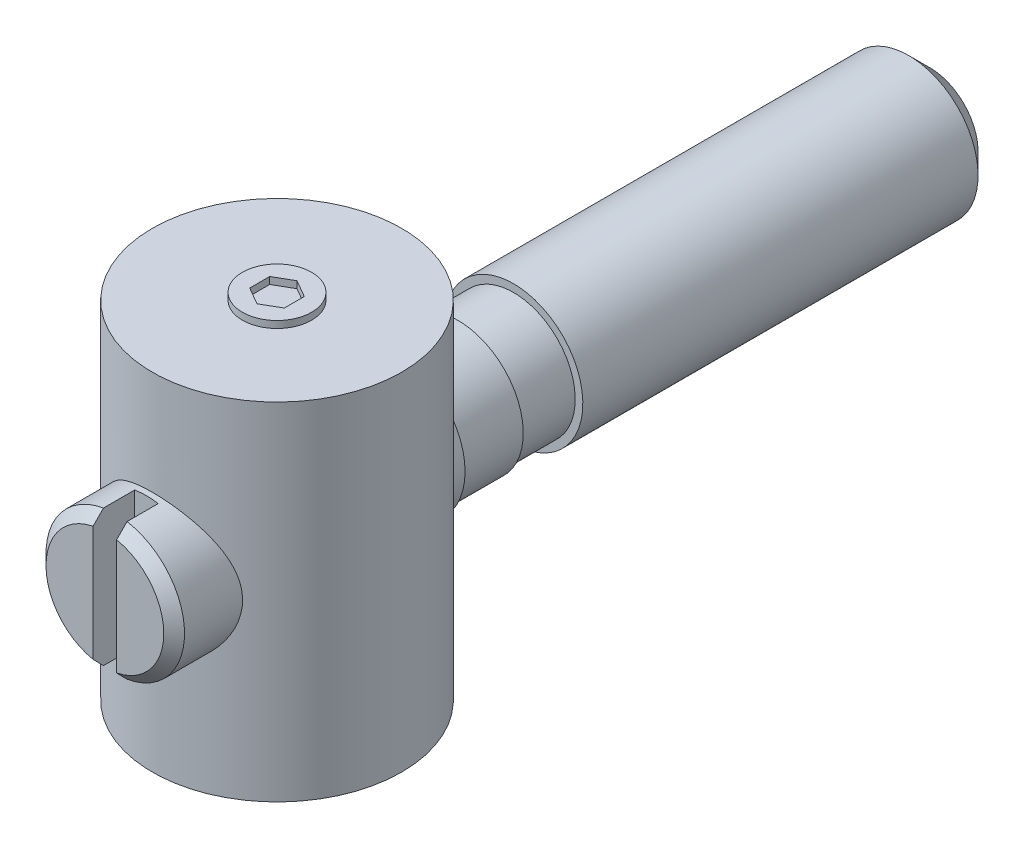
ISO-10303-21;
HEADER;
FILE_DESCRIPTION(('STEP AP214'),'2;1');
FILE_NAME('part.step','',(''),(''),'','','');
FILE_SCHEMA(('AUTOMOTIVE_DESIGN { 1 0 10303 214 1 1 1 1 }'));
ENDSEC;
DATA;
#1=APPLICATION_CONTEXT('core data for automotive mechanical design processes');
#2=APPLICATION_PROTOCOL_DEFINITION('international standard','automotive_design',2000,#1);
#3=PRODUCT_CONTEXT('',#1,'mechanical');
#4=PRODUCT('Part','Part','',(#3));
#5=PRODUCT_RELATED_PRODUCT_CATEGORY('part','',(#4));
#6=PRODUCT_DEFINITION_FORMATION('','',#4);
#7=PRODUCT_DEFINITION_CONTEXT('part definition',#1,'design');
#8=PRODUCT_DEFINITION('design','',#6,#7);
#9=PRODUCT_DEFINITION_SHAPE('','',#8);
#10=(LENGTH_UNIT() NAMED_UNIT(*) SI_UNIT(.MILLI.,.METRE.));
#11=(NAMED_UNIT(*) PLANE_ANGLE_UNIT() SI_UNIT($,.RADIAN.));
#12=(NAMED_UNIT(*) SI_UNIT($,.STERADIAN.) SOLID_ANGLE_UNIT());
#13=UNCERTAINTY_MEASURE_WITH_UNIT(LENGTH_MEASURE(1.E-05),#10,'distance_accuracy_value','');
#14=(GEOMETRIC_REPRESENTATION_CONTEXT(3) GLOBAL_UNCERTAINTY_ASSIGNED_CONTEXT((#13)) GLOBAL_UNIT_ASSIGNED_CONTEXT((#10,
#11,#12)) REPRESENTATION_CONTEXT('',''));
#15=CARTESIAN_POINT('',(0.,0.,0.));
#16=DIRECTION('',(0.,0.,1.));
#17=DIRECTION('',(1.,0.,0.));
#18=AXIS2_PLACEMENT_3D('',#15,#16,#17);
#19=CARTESIAN_POINT('',(0.,0.,12.4245));
#20=DIRECTION('',(0.,0.,-1.));
#21=DIRECTION('',(0.,1.,0.));
#22=AXIS2_PLACEMENT_3D('',#19,#20,#21);
#23=PLANE('',#22);
#24=CARTESIAN_POINT('',(0.,0.,12.4245));
#25=DIRECTION('',(0.,0.,-1.));
#26=DIRECTION('',(0.,1.,0.));
#27=AXIS2_PLACEMENT_3D('',#24,#25,#26);
#28=CIRCLE('',#27,4.25);
#29=CARTESIAN_POINT('',(0.85,-4.16413256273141,12.4245));
#30=VERTEX_POINT('',#29);
#31=CARTESIAN_POINT('',(0.85,4.16413256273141,12.4245));
#32=VERTEX_POINT('',#31);
#33=EDGE_CURVE('E175',#30,#32,#28,.F.);
#34=ORIENTED_EDGE('',*,*,#33,.T.);
#35=DIRECTION('',(0.,1.,0.));
#36=VECTOR('',#35,1.);
#37=CARTESIAN_POINT('',(0.85,4.92722031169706,12.4245));
#38=LINE('',#37,#36);
#39=EDGE_CURVE('E353',#30,#32,#38,.T.);
#40=ORIENTED_EDGE('',*,*,#39,.F.);
#41=EDGE_LOOP('',(#34,#40));
#42=FACE_BOUND('',#41,.T.);
#43=ADVANCED_FACE('F14',(#42),#23,.F.);
#44=CARTESIAN_POINT('',(-0.85,4.16413256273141,12.4245));
#45=VERTEX_POINT('',#44);
#46=CARTESIAN_POINT('',(-0.85,-4.16413256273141,12.4245));
#47=VERTEX_POINT('',#46);
#48=EDGE_CURVE('E176',#45,#47,#28,.F.);
#49=ORIENTED_EDGE('',*,*,#48,.T.);
#50=DIRECTION('',(0.,-1.,0.));
#51=VECTOR('',#50,1.);
#52=CARTESIAN_POINT('',(-0.85,4.92722031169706,12.4245));
#53=LINE('',#52,#51);
#54=EDGE_CURVE('E408',#45,#47,#53,.T.);
#55=ORIENTED_EDGE('',*,*,#54,.F.);
#56=EDGE_LOOP('',(#49,#55));
#57=FACE_BOUND('',#56,.T.);
#58=ADVANCED_FACE('F213',(#57),#23,.F.);
#59=CARTESIAN_POINT('',(0.,0.,12.4245));
#60=DIRECTION('',(0.,0.,-1.));
#61=DIRECTION('',(0.,1.,0.));
#62=AXIS2_PLACEMENT_3D('',#59,#60,#61);
#63=CONICAL_SURFACE('',#62,4.25,0.785398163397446);
#64=CARTESIAN_POINT('',(0.85,-10.8571842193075,5.7840937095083));
#65=CARTESIAN_POINT('',(0.850000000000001,-10.471658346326,6.16843314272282));
#66=CARTESIAN_POINT('',(0.850000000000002,-10.0860798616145,6.55271985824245));
#67=CARTESIAN_POINT('',(0.850000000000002,-9.31472993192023,7.32113134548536));
#68=CARTESIAN_POINT('',(0.850000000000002,-8.92895847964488,7.7052561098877));
#69=CARTESIAN_POINT('',(0.850000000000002,-8.15678249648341,8.47363775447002));
#70=CARTESIAN_POINT('',(0.850000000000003,-7.77037771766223,8.85789438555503));
#71=CARTESIAN_POINT('',(0.850000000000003,-6.9971971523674,9.6260032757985));
#72=CARTESIAN_POINT('',(0.850000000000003,-6.61042138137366,10.0098555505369));
#73=CARTESIAN_POINT('',(0.850000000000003,-5.8547904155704,10.7585441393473));
#74=CARTESIAN_POINT('',(0.850000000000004,-5.48596470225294,11.1234101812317));
#75=CARTESIAN_POINT('',(0.850000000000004,-4.93193044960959,11.6699477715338));
#76=CARTESIAN_POINT('',(0.850000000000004,-4.74710850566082,11.852011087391));
#77=CARTESIAN_POINT('',(0.850000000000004,-4.37709943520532,12.2157621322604));
#78=CARTESIAN_POINT('',(0.850000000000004,-4.19191231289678,12.3974498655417));
#79=CARTESIAN_POINT('',(0.850000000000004,-3.82111814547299,12.7601731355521));
#80=CARTESIAN_POINT('',(0.850000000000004,-3.63551142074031,12.9412089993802));
#81=CARTESIAN_POINT('',(0.850000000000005,-3.26347010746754,13.3024446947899));
#82=CARTESIAN_POINT('',(0.850000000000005,-3.07703548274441,13.4826444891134));
#83=CARTESIAN_POINT('',(0.850000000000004,-2.70287506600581,13.8416259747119));
#84=CARTESIAN_POINT('',(0.850000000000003,-2.51514955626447,14.0204079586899));
#85=CARTESIAN_POINT('',(0.850000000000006,-2.23171685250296,14.2866057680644));
#86=CARTESIAN_POINT('',(0.850000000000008,-2.1369352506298,14.3750060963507));
#87=CARTESIAN_POINT('',(0.850000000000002,-1.94648080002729,14.5508404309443));
#88=CARTESIAN_POINT('',(0.849999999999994,-1.85080797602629,14.6382744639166));
#89=CARTESIAN_POINT('',(0.850000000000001,-1.72767566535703,14.7490832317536));
#90=CARTESIAN_POINT('',(0.850000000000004,-1.70082923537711,14.7731393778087));
#91=CARTESIAN_POINT('',(0.850000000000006,-1.64701809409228,14.8211193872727));
#92=CARTESIAN_POINT('',(0.850000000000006,-1.6200533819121,14.8450432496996));
#93=CARTESIAN_POINT('',(0.850000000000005,-1.53895497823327,14.9165942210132));
#94=CARTESIAN_POINT('',(0.850000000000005,-1.48462201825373,14.9639962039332));
#95=CARTESIAN_POINT('',(0.850000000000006,-1.37483312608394,15.0583713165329));
#96=CARTESIAN_POINT('',(0.850000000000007,-1.31937170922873,15.1053380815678));
#97=CARTESIAN_POINT('',(0.850000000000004,-1.20752807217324,15.1981369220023));
#98=CARTESIAN_POINT('',(0.85,-1.15114610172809,15.2439692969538));
#99=CARTESIAN_POINT('',(0.85,-1.03663150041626,15.3344042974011));
#100=CARTESIAN_POINT('',(0.850000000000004,-0.9784881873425,15.3789934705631));
#101=CARTESIAN_POINT('',(0.850000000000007,-0.860303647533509,15.4657790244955));
#102=CARTESIAN_POINT('',(0.850000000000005,-0.80026014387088,15.5079723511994));
#103=CARTESIAN_POINT('',(0.850000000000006,-0.678046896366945,15.5881646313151));
#104=CARTESIAN_POINT('',(0.850000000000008,-0.615896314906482,15.6261924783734));
#105=CARTESIAN_POINT('',(0.850000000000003,-0.488100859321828,15.6957876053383));
#106=CARTESIAN_POINT('',(0.849999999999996,-0.422466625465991,15.7273732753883));
#107=CARTESIAN_POINT('',(0.850000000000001,-0.329088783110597,15.763320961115));
#108=CARTESIAN_POINT('',(0.850000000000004,-0.303167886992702,15.7723966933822));
#109=CARTESIAN_POINT('',(0.850000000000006,-0.250726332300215,15.7886439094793));
#110=CARTESIAN_POINT('',(0.850000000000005,-0.224205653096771,15.795815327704));
#111=CARTESIAN_POINT('',(0.850000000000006,-0.170756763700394,15.8079066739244));
#112=CARTESIAN_POINT('',(0.850000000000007,-0.143830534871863,15.8128352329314));
#113=CARTESIAN_POINT('',(0.850000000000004,-0.0896414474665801,15.820207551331));
#114=CARTESIAN_POINT('',(0.85,-0.0623786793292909,15.822651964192));
#115=CARTESIAN_POINT('',(0.85,-0.0075372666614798,15.824910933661));
#116=CARTESIAN_POINT('',(0.850000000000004,0.0200422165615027,15.82470572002));
#117=CARTESIAN_POINT('',(0.850000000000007,0.0750465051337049,15.821636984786));
#118=CARTESIAN_POINT('',(0.850000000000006,0.102471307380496,15.8187734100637));
#119=CARTESIAN_POINT('',(0.850000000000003,0.184310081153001,15.8064148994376));
#120=CARTESIAN_POINT('',(0.85,0.238169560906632,15.7931483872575));
#121=CARTESIAN_POINT('',(0.85,0.341986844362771,15.7595828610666));
#122=CARTESIAN_POINT('',(0.850000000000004,0.392008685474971,15.7394689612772));
#123=CARTESIAN_POINT('',(0.850000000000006,0.489870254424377,15.6944042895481));
#124=CARTESIAN_POINT('',(0.850000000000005,0.537706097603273,15.6694452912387));
#125=CARTESIAN_POINT('',(0.850000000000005,0.631894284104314,15.616071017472));
#126=CARTESIAN_POINT('',(0.850000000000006,0.678231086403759,15.5876288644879));
#127=CARTESIAN_POINT('',(0.850000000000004,0.769393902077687,15.5285213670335));
#128=CARTESIAN_POINT('',(0.85,0.814221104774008,15.4978578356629));
#129=CARTESIAN_POINT('',(0.85,0.906418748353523,15.4323418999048));
#130=CARTESIAN_POINT('',(0.850000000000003,0.953691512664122,15.3973530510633));
#131=CARTESIAN_POINT('',(0.850000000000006,1.04723694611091,15.3260585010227));
#132=CARTESIAN_POINT('',(0.850000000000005,1.09350947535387,15.2897526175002));
#133=CARTESIAN_POINT('',(0.850000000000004,1.23123275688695,15.1793793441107));
#134=CARTESIAN_POINT('',(0.850000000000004,1.32154148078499,15.1038914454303));
#135=CARTESIAN_POINT('',(0.850000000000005,1.50045598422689,14.9506177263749));
#136=CARTESIAN_POINT('',(0.850000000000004,1.58905825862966,14.8728278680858));
#137=CARTESIAN_POINT('',(0.850000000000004,1.76500186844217,14.7158903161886));
#138=CARTESIAN_POINT('',(0.850000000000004,1.85234357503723,14.6367430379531));
#139=CARTESIAN_POINT('',(0.850000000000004,2.0259304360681,14.4777547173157));
#140=CARTESIAN_POINT('',(0.850000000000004,2.11217801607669,14.3979163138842));
#141=CARTESIAN_POINT('',(0.850000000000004,2.28407604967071,14.2375871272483));
#142=CARTESIAN_POINT('',(0.850000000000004,2.36972645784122,14.1570962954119));
#143=CARTESIAN_POINT('',(0.850000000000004,2.54048363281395,13.9957355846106));
#144=CARTESIAN_POINT('',(0.850000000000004,2.62559090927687,13.9148662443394));
#145=CARTESIAN_POINT('',(0.850000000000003,2.79546438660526,13.7527747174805));
#146=CARTESIAN_POINT('',(0.850000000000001,2.8802305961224,13.6715525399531));
#147=CARTESIAN_POINT('',(0.849999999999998,3.1320378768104,13.4295009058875));
#148=CARTESIAN_POINT('',(0.850000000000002,3.29870204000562,13.2682794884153));
#149=CARTESIAN_POINT('',(0.850000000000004,3.63138320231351,12.9451699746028));
#150=CARTESIAN_POINT('',(0.850000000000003,3.79740019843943,12.7832818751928));
#151=CARTESIAN_POINT('',(0.850000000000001,4.29480941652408,12.2969477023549));
#152=CARTESIAN_POINT('',(0.850000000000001,4.62555293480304,11.9718384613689));
#153=CARTESIAN_POINT('',(0.850000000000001,5.28633819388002,11.3205425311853));
#154=CARTESIAN_POINT('',(0.850000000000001,5.61637944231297,10.9943553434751));
#155=CARTESIAN_POINT('',(0.85,6.27592616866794,10.3414463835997));
#156=CARTESIAN_POINT('',(0.85,6.60543165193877,10.0147246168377));
#157=CARTESIAN_POINT('',(0.849999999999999,7.2621714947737,9.36286110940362));
#158=CARTESIAN_POINT('',(0.849999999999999,7.58940782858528,9.03772135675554));
#159=CARTESIAN_POINT('',(0.849999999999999,8.24365487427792,8.38721275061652));
#160=CARTESIAN_POINT('',(0.849999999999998,8.57066558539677,8.06184389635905));
#161=CARTESIAN_POINT('',(0.849999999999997,9.22432804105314,7.41114429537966));
#162=CARTESIAN_POINT('',(0.849999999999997,9.55097988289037,7.08581364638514));
#163=CARTESIAN_POINT('',(0.849999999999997,10.2041625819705,6.43503329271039));
#164=CARTESIAN_POINT('',(0.849999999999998,10.53069343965,6.10958358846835));
#165=CARTESIAN_POINT('',(0.85,10.8571842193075,5.78409370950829));
#166=B_SPLINE_CURVE_WITH_KNOTS('',3,(#64,#65,#66,#67,#68,#69,#70,#71,#72,#73,#74,#75,#76,#77,
#78,#79,#80,#81,#82,#83,#84,#85,#86,#87,#88,#89,#90,#91,#92,#93,#94,#95,#96,#97,#98,#99,#100,
#101,#102,#103,#104,#105,#106,#107,#108,#109,#110,#111,#112,#113,#114,#115,#116,#117,#118,#119,
#120,#121,#122,#123,#124,#125,#126,#127,#128,#129,#130,#131,#132,#133,#134,#135,#136,#137,#138,
#139,#140,#141,#142,#143,#144,#145,#146,#147,#148,#149,#150,#151,#152,#153,#154,#155,#156,#157,
#158,#159,#160,#161,#162,#163,#164,#165),.UNSPECIFIED.,.F.,.F.,(4,2,2,2,2,2,2,2,2,2,2,2,2,2,2,2,
2,2,2,2,2,2,2,2,2,2,2,2,2,2,2,2,2,2,2,2,2,2,2,2,2,2,2,2,2,2,2,2,2,2,4),(0.,1.63313292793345,
3.26633311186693,4.90115899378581,6.53591939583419,8.0923359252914,8.87063870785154,
9.6489325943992,10.4267573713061,11.2046164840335,11.9823105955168,12.3711302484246,
12.7599391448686,12.8680815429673,12.9762247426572,13.192531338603,13.4105501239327,
13.6285107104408,13.8482899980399,14.06834343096,14.2867582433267,14.5045405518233,
14.5868729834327,14.6692082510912,14.7512239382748,14.8332180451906,14.9158243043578,
14.9984322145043,15.1639989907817,15.3254048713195,15.4870872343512,15.6501067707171,
15.8129947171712,15.9894007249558,16.1658312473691,16.5188698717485,16.8725695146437,
17.2261627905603,17.5787425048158,17.9313487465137,18.2835517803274,18.6357458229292,
19.3313885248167,20.0270344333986,21.4183551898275,22.8104494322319,24.2025296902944,
25.5864353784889,26.9703457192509,28.3534122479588,29.7364737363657),.UNSPECIFIED.);
#167=CARTESIAN_POINT('',(0.85,-4.92722031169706,11.6745));
#168=VERTEX_POINT('',#167);
#169=EDGE_CURVE('E191',#168,#30,#166,.T.);
#170=ORIENTED_EDGE('',*,*,#169,.F.);
#171=CARTESIAN_POINT('',(0.,0.,11.6745));
#172=DIRECTION('',(0.,0.,-1.));
#173=DIRECTION('',(0.,1.,0.));
#174=AXIS2_PLACEMENT_3D('',#171,#172,#173);
#175=CIRCLE('',#174,5.);
#176=CARTESIAN_POINT('',(0.85,4.92722031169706,11.6745));
#177=VERTEX_POINT('',#176);
#178=EDGE_CURVE('E180',#177,#168,#175,.T.);
#179=ORIENTED_EDGE('',*,*,#178,.F.);
#180=EDGE_CURVE('E183',#32,#177,#166,.T.);
#181=ORIENTED_EDGE('',*,*,#180,.F.);
#182=ORIENTED_EDGE('',*,*,#33,.F.);
#183=EDGE_LOOP('',(#170,#179,#181,#182));
#184=FACE_BOUND('',#183,.T.);
#185=ADVANCED_FACE('F199',(#184),#63,.T.);
#186=CARTESIAN_POINT('',(0.85,4.92722031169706,9.4245));
#187=DIRECTION('',(1.,0.,0.));
#188=DIRECTION('',(0.,1.,0.));
#189=AXIS2_PLACEMENT_3D('',#186,#187,#188);
#190=PLANE('',#189);
#191=ORIENTED_EDGE('',*,*,#169,.T.);
#192=ORIENTED_EDGE('',*,*,#39,.T.);
#193=ORIENTED_EDGE('',*,*,#180,.T.);
#194=DIRECTION('',(0.,0.,1.));
#195=VECTOR('',#194,1.);
#196=CARTESIAN_POINT('',(0.85,4.92722031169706,9.4245));
#197=LINE('',#196,#195);
#198=CARTESIAN_POINT('',(0.85,4.92722031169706,9.4245));
#199=VERTEX_POINT('',#198);
#200=EDGE_CURVE('E424',#199,#177,#197,.T.);
#201=ORIENTED_EDGE('',*,*,#200,.F.);
#202=DIRECTION('',(0.,1.,0.));
#203=VECTOR('',#202,1.);
#204=CARTESIAN_POINT('',(0.85,4.92722031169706,9.4245));
#205=LINE('',#204,#203);
#206=CARTESIAN_POINT('',(0.85,-4.92722031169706,9.4245));
#207=VERTEX_POINT('',#206);
#208=EDGE_CURVE('E87',#207,#199,#205,.T.);
#209=ORIENTED_EDGE('',*,*,#208,.F.);
#210=DIRECTION('',(0.,0.,1.));
#211=VECTOR('',#210,1.);
#212=CARTESIAN_POINT('',(0.85,-4.92722031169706,9.4245));
#213=LINE('',#212,#211);
#214=EDGE_CURVE('E426',#207,#168,#213,.T.);
#215=ORIENTED_EDGE('',*,*,#214,.T.);
#216=EDGE_LOOP('',(#191,#192,#193,#201,#209,#215));
#217=FACE_BOUND('',#216,.T.);
#218=ADVANCED_FACE('F203',(#217),#190,.F.);
#219=CARTESIAN_POINT('',(0.,0.,9.4245));
#220=DIRECTION('',(0.,0.,1.));
#221=DIRECTION('',(0.,-1.,0.));
#222=AXIS2_PLACEMENT_3D('',#219,#220,#221);
#223=PLANE('',#222);
#224=CARTESIAN_POINT('',(0.,0.,9.4245));
#225=DIRECTION('',(0.,0.,1.));
#226=DIRECTION('',(0.,-1.,0.));
#227=AXIS2_PLACEMENT_3D('',#224,#225,#226);
#228=CIRCLE('',#227,5.);
#229=CARTESIAN_POINT('',(-0.85,-4.92722031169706,9.4245));
#230=VERTEX_POINT('',#229);
#231=EDGE_CURVE('E412',#230,#207,#228,.T.);
#232=ORIENTED_EDGE('',*,*,#231,.T.);
#233=ORIENTED_EDGE('',*,*,#208,.T.);
#234=CARTESIAN_POINT('',(0.,0.,9.4245));
#235=DIRECTION('',(0.,0.,1.));
#236=DIRECTION('',(0.,-1.,0.));
#237=AXIS2_PLACEMENT_3D('',#234,#235,#236);
#238=CIRCLE('',#237,5.);
#239=CARTESIAN_POINT('',(-0.85,4.92722031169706,9.4245));
#240=VERTEX_POINT('',#239);
#241=EDGE_CURVE('E430',#199,#240,#238,.T.);
#242=ORIENTED_EDGE('',*,*,#241,.T.);
#243=DIRECTION('',(0.,-1.,0.));
#244=VECTOR('',#243,1.);
#245=CARTESIAN_POINT('',(-0.85,4.92722031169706,9.4245));
#246=LINE('',#245,#244);
#247=EDGE_CURVE('E415',#240,#230,#246,.T.);
#248=ORIENTED_EDGE('',*,*,#247,.T.);
#249=EDGE_LOOP('',(#232,#233,#242,#248));
#250=FACE_BOUND('',#249,.T.);
#251=ADVANCED_FACE('F207',(#250),#223,.T.);
#252=CARTESIAN_POINT('',(-0.85,4.92722031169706,9.4245));
#253=DIRECTION('',(-1.,0.,0.));
#254=DIRECTION('',(0.,-1.,0.));
#255=AXIS2_PLACEMENT_3D('',#252,#253,#254);
#256=PLANE('',#255);
#257=CARTESIAN_POINT('',(-0.85,10.8571842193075,5.7840937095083));
#258=CARTESIAN_POINT('',(-0.850000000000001,10.471658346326,6.16843314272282));
#259=CARTESIAN_POINT('',(-0.850000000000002,10.0860798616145,6.55271985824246));
#260=CARTESIAN_POINT('',(-0.850000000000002,9.31472993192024,7.32113134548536));
#261=CARTESIAN_POINT('',(-0.850000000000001,8.92895847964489,7.7052561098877));
#262=CARTESIAN_POINT('',(-0.850000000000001,8.15678249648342,8.47363775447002));
#263=CARTESIAN_POINT('',(-0.85,7.77037771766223,8.85789438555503));
#264=CARTESIAN_POINT('',(-0.85,6.99719715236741,9.6260032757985));
#265=CARTESIAN_POINT('',(-0.85,6.61042138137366,10.0098555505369));
#266=CARTESIAN_POINT('',(-0.849999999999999,5.8547904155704,10.7585441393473));
#267=CARTESIAN_POINT('',(-0.849999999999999,5.48596470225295,11.1234101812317));
#268=CARTESIAN_POINT('',(-0.849999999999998,4.93193044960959,11.6699477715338));
#269=CARTESIAN_POINT('',(-0.849999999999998,4.74710850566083,11.852011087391));
#270=CARTESIAN_POINT('',(-0.849999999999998,4.37709943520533,12.2157621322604));
#271=CARTESIAN_POINT('',(-0.849999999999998,4.19191231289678,12.3974498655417));
#272=CARTESIAN_POINT('',(-0.849999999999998,3.82111814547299,12.7601731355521));
#273=CARTESIAN_POINT('',(-0.849999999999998,3.63551142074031,12.9412089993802));
#274=CARTESIAN_POINT('',(-0.849999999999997,3.26347010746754,13.3024446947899));
#275=CARTESIAN_POINT('',(-0.849999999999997,3.07703548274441,13.4826444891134));
#276=CARTESIAN_POINT('',(-0.849999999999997,2.70287506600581,13.8416259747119));
#277=CARTESIAN_POINT('',(-0.849999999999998,2.51514955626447,14.0204079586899));
#278=CARTESIAN_POINT('',(-0.849999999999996,2.23171685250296,14.2866057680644));
#279=CARTESIAN_POINT('',(-0.849999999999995,2.13693525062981,14.3750060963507));
#280=CARTESIAN_POINT('',(-0.849999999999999,1.94648080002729,14.5508404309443));
#281=CARTESIAN_POINT('',(-0.850000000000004,1.85080797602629,14.6382744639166));
#282=CARTESIAN_POINT('',(-0.849999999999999,1.72767566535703,14.7490832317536));
#283=CARTESIAN_POINT('',(-0.849999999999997,1.70082923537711,14.7731393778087));
#284=CARTESIAN_POINT('',(-0.849999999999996,1.64701809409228,14.8211193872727));
#285=CARTESIAN_POINT('',(-0.849999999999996,1.6200533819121,14.8450432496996));
#286=CARTESIAN_POINT('',(-0.849999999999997,1.53895497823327,14.9165942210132));
#287=CARTESIAN_POINT('',(-0.849999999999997,1.48462201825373,14.9639962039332));
#288=CARTESIAN_POINT('',(-0.849999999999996,1.37483312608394,15.0583713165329));
#289=CARTESIAN_POINT('',(-0.849999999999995,1.31937170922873,15.1053380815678));
#290=CARTESIAN_POINT('',(-0.849999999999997,1.20752807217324,15.1981369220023));
#291=CARTESIAN_POINT('',(-0.85,1.15114610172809,15.2439692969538));
#292=CARTESIAN_POINT('',(-0.85,1.03663150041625,15.3344042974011));
#293=CARTESIAN_POINT('',(-0.849999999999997,0.9784881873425,15.3789934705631));
#294=CARTESIAN_POINT('',(-0.849999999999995,0.860303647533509,15.4657790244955));
#295=CARTESIAN_POINT('',(-0.849999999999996,0.80026014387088,15.5079723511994));
#296=CARTESIAN_POINT('',(-0.849999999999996,0.678046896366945,15.5881646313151));
#297=CARTESIAN_POINT('',(-0.849999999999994,0.615896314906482,15.6261924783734));
#298=CARTESIAN_POINT('',(-0.849999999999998,0.488100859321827,15.6957876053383));
#299=CARTESIAN_POINT('',(-0.850000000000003,0.422466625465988,15.7273732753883));
#300=CARTESIAN_POINT('',(-0.849999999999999,0.329088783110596,15.763320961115));
#301=CARTESIAN_POINT('',(-0.849999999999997,0.303167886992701,15.7723966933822));
#302=CARTESIAN_POINT('',(-0.849999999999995,0.250726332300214,15.7886439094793));
#303=CARTESIAN_POINT('',(-0.849999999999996,0.224205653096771,15.795815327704));
#304=CARTESIAN_POINT('',(-0.849999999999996,0.170756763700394,15.8079066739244));
#305=CARTESIAN_POINT('',(-0.849999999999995,0.143830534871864,15.8128352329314));
#306=CARTESIAN_POINT('',(-0.849999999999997,0.0896414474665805,15.820207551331));
#307=CARTESIAN_POINT('',(-0.85,0.0623786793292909,15.822651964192));
#308=CARTESIAN_POINT('',(-0.85,0.00753726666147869,15.824910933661));
#309=CARTESIAN_POINT('',(-0.849999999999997,-0.0200422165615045,15.82470572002));
#310=CARTESIAN_POINT('',(-0.849999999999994,-0.0750465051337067,15.821636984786));
#311=CARTESIAN_POINT('',(-0.849999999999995,-0.102471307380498,15.8187734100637));
#312=CARTESIAN_POINT('',(-0.849999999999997,-0.184310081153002,15.8064148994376));
#313=CARTESIAN_POINT('',(-0.85,-0.238169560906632,15.7931483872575));
#314=CARTESIAN_POINT('',(-0.85,-0.341986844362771,15.7595828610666));
#315=CARTESIAN_POINT('',(-0.849999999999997,-0.392008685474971,15.7394689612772));
#316=CARTESIAN_POINT('',(-0.849999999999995,-0.489870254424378,15.6944042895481));
#317=CARTESIAN_POINT('',(-0.849999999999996,-0.537706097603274,15.6694452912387));
#318=CARTESIAN_POINT('',(-0.849999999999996,-0.631894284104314,15.616071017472));
#319=CARTESIAN_POINT('',(-0.849999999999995,-0.67823108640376,15.5876288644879));
#320=CARTESIAN_POINT('',(-0.849999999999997,-0.769393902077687,15.5285213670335));
#321=CARTESIAN_POINT('',(-0.85,-0.814221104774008,15.4978578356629));
#322=CARTESIAN_POINT('',(-0.85,-0.906418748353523,15.4323418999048));
#323=CARTESIAN_POINT('',(-0.849999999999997,-0.953691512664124,15.3973530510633));
#324=CARTESIAN_POINT('',(-0.849999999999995,-1.04723694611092,15.3260585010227));
#325=CARTESIAN_POINT('',(-0.849999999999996,-1.09350947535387,15.2897526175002));
#326=CARTESIAN_POINT('',(-0.849999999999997,-1.23123275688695,15.1793793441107));
#327=CARTESIAN_POINT('',(-0.849999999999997,-1.32154148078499,15.1038914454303));
#328=CARTESIAN_POINT('',(-0.849999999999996,-1.50045598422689,14.9506177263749));
#329=CARTESIAN_POINT('',(-0.849999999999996,-1.58905825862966,14.8728278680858));
#330=CARTESIAN_POINT('',(-0.849999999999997,-1.76500186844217,14.7158903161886));
#331=CARTESIAN_POINT('',(-0.849999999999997,-1.85234357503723,14.6367430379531));
#332=CARTESIAN_POINT('',(-0.849999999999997,-2.0259304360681,14.4777547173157));
#333=CARTESIAN_POINT('',(-0.849999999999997,-2.11217801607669,14.3979163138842));
#334=CARTESIAN_POINT('',(-0.849999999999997,-2.28407604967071,14.2375871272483));
#335=CARTESIAN_POINT('',(-0.849999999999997,-2.36972645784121,14.1570962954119));
#336=CARTESIAN_POINT('',(-0.849999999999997,-2.54048363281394,13.9957355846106));
#337=CARTESIAN_POINT('',(-0.849999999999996,-2.62559090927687,13.9148662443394));
#338=CARTESIAN_POINT('',(-0.849999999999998,-2.79546438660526,13.7527747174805));
#339=CARTESIAN_POINT('',(-0.849999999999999,-2.8802305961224,13.6715525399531));
#340=CARTESIAN_POINT('',(-0.850000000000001,-3.1320378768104,13.4295009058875));
#341=CARTESIAN_POINT('',(-0.849999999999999,-3.29870204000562,13.2682794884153));
#342=CARTESIAN_POINT('',(-0.849999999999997,-3.63138320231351,12.9451699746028));
#343=CARTESIAN_POINT('',(-0.849999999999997,-3.79740019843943,12.7832818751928));
#344=CARTESIAN_POINT('',(-0.849999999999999,-4.29480941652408,12.2969477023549));
#345=CARTESIAN_POINT('',(-0.849999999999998,-4.62555293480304,11.9718384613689));
#346=CARTESIAN_POINT('',(-0.849999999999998,-5.28633819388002,11.3205425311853));
#347=CARTESIAN_POINT('',(-0.849999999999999,-5.61637944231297,10.9943553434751));
#348=CARTESIAN_POINT('',(-0.849999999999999,-6.27592616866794,10.3414463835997));
#349=CARTESIAN_POINT('',(-0.85,-6.60543165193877,10.0147246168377));
#350=CARTESIAN_POINT('',(-0.85,-7.2621714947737,9.36286110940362));
#351=CARTESIAN_POINT('',(-0.85,-7.58940782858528,9.03772135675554));
#352=CARTESIAN_POINT('',(-0.850000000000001,-8.24365487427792,8.38721275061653));
#353=CARTESIAN_POINT('',(-0.850000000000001,-8.57066558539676,8.06184389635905));
#354=CARTESIAN_POINT('',(-0.850000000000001,-9.22432804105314,7.41114429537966));
#355=CARTESIAN_POINT('',(-0.850000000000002,-9.55097988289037,7.08581364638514));
#356=CARTESIAN_POINT('',(-0.850000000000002,-10.2041625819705,6.43503329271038));
#357=CARTESIAN_POINT('',(-0.850000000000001,-10.53069343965,6.10958358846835));
#358=CARTESIAN_POINT('',(-0.85,-10.8571842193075,5.78409370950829));
#359=B_SPLINE_CURVE_WITH_KNOTS('',3,(#257,#258,#259,#260,#261,#262,#263,#264,#265,#266,#267,
#268,#269,#270,#271,#272,#273,#274,#275,#276,#277,#278,#279,#280,#281,#282,#283,#284,#285,#286,
#287,#288,#289,#290,#291,#292,#293,#294,#295,#296,#297,#298,#299,#300,#301,#302,#303,#304,#305,
#306,#307,#308,#309,#310,#311,#312,#313,#314,#315,#316,#317,#318,#319,#320,#321,#322,#323,#324,
#325,#326,#327,#328,#329,#330,#331,#332,#333,#334,#335,#336,#337,#338,#339,#340,#341,#342,#343,
#344,#345,#346,#347,#348,#349,#350,#351,#352,#353,#354,#355,#356,#357,#358),.UNSPECIFIED.,.F.,
.F.,(4,2,2,2,2,2,2,2,2,2,2,2,2,2,2,2,2,2,2,2,2,2,2,2,2,2,2,2,2,2,2,2,2,2,2,2,2,2,2,2,2,2,2,2,2,
2,2,2,2,2,4),(0.,1.63313292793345,3.26633311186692,4.90115899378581,6.53591939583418,
8.0923359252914,8.87063870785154,9.6489325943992,10.4267573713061,11.2046164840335,
11.9823105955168,12.3711302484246,12.7599391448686,12.8680815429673,12.9762247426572,
13.192531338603,13.4105501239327,13.6285107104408,13.8482899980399,14.06834343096,
14.2867582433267,14.5045405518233,14.5868729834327,14.6692082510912,14.7512239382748,
14.8332180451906,14.9158243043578,14.9984322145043,15.1639989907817,15.3254048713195,
15.4870872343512,15.6501067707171,15.8129947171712,15.9894007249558,16.1658312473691,
16.5188698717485,16.8725695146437,17.2261627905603,17.5787425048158,17.9313487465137,
18.2835517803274,18.6357458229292,19.3313885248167,20.0270344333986,21.4183551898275,
22.8104494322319,24.2025296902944,25.5864353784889,26.9703457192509,28.3534122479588,
29.7364737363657),.UNSPECIFIED.);
#360=CARTESIAN_POINT('',(-0.85,4.92722031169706,11.6745));
#361=VERTEX_POINT('',#360);
#362=EDGE_CURVE('E443',#361,#45,#359,.T.);
#363=ORIENTED_EDGE('',*,*,#362,.T.);
#364=ORIENTED_EDGE('',*,*,#54,.T.);
#365=CARTESIAN_POINT('',(-0.85,-4.92722031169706,11.6745));
#366=VERTEX_POINT('',#365);
#367=EDGE_CURVE('E192',#47,#366,#359,.T.);
#368=ORIENTED_EDGE('',*,*,#367,.T.);
#369=DIRECTION('',(0.,0.,1.));
#370=VECTOR('',#369,1.);
#371=CARTESIAN_POINT('',(-0.85,-4.92722031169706,9.4245));
#372=LINE('',#371,#370);
#373=EDGE_CURVE('E418',#230,#366,#372,.T.);
#374=ORIENTED_EDGE('',*,*,#373,.F.);
#375=ORIENTED_EDGE('',*,*,#247,.F.);
#376=DIRECTION('',(0.,0.,1.));
#377=VECTOR('',#376,1.);
#378=CARTESIAN_POINT('',(-0.85,4.92722031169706,9.4245));
#379=LINE('',#378,#377);
#380=EDGE_CURVE('E422',#240,#361,#379,.T.);
#381=ORIENTED_EDGE('',*,*,#380,.T.);
#382=EDGE_LOOP('',(#363,#364,#368,#374,#375,#381));
#383=FACE_BOUND('',#382,.T.);
#384=ADVANCED_FACE('F208',(#383),#256,.F.);
#385=ORIENTED_EDGE('',*,*,#362,.F.);
#386=EDGE_CURVE('E179',#366,#361,#175,.T.);
#387=ORIENTED_EDGE('',*,*,#386,.F.);
#388=ORIENTED_EDGE('',*,*,#367,.F.);
#389=ORIENTED_EDGE('',*,*,#48,.F.);
#390=EDGE_LOOP('',(#385,#387,#388,#389));
#391=FACE_BOUND('',#390,.T.);
#392=ADVANCED_FACE('F301',(#391),#63,.T.);
#393=CARTESIAN_POINT('',(0.,0.,42.719865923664));
#394=DIRECTION('',(0.,0.,1.));
#395=DIRECTION('',(0.,-1.,0.));
#396=AXIS2_PLACEMENT_3D('',#393,#394,#395);
#397=CYLINDRICAL_SURFACE('',#396,5.);
#398=ORIENTED_EDGE('',*,*,#386,.T.);
#399=ORIENTED_EDGE('',*,*,#380,.F.);
#400=ORIENTED_EDGE('',*,*,#241,.F.);
#401=ORIENTED_EDGE('',*,*,#200,.T.);
#402=ORIENTED_EDGE('',*,*,#178,.T.);
#403=ORIENTED_EDGE('',*,*,#214,.F.);
#404=ORIENTED_EDGE('',*,*,#231,.F.);
#405=ORIENTED_EDGE('',*,*,#373,.T.);
#406=EDGE_LOOP('',(#398,#399,#400,#401,#402,#403,#404,#405));
#407=FACE_BOUND('',#406,.T.);
#408=CARTESIAN_POINT('',(0.,-5.,9.));
#409=CARTESIAN_POINT('',(-0.129728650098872,-5.00000040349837,9.00000035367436));
#410=CARTESIAN_POINT('',(-0.259452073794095,-4.99494572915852,8.99718916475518));
#411=CARTESIAN_POINT('',(-0.517921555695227,-4.9747929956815,8.98601661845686));
#412=CARTESIAN_POINT('',(-0.646667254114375,-4.95969140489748,8.97765330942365));
#413=CARTESIAN_POINT('',(-0.902114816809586,-4.9196443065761,8.95559163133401));
#414=CARTESIAN_POINT('',(-1.02881719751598,-4.89470132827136,8.94189463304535));
#415=CARTESIAN_POINT('',(-1.27935747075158,-4.83526936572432,8.90950110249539));
#416=CARTESIAN_POINT('',(-1.40319416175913,-4.80077645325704,8.89080251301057));
#417=CARTESIAN_POINT('',(-1.64664425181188,-4.72279881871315,8.84894060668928));
#418=CARTESIAN_POINT('',(-1.76627303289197,-4.67935197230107,8.82579612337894));
#419=CARTESIAN_POINT('',(-2.00118015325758,-4.58381684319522,8.77551906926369));
#420=CARTESIAN_POINT('',(-2.11645683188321,-4.53172530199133,8.74838499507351));
#421=CARTESIAN_POINT('',(-2.45478877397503,-4.36318845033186,8.6618736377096));
#422=CARTESIAN_POINT('',(-2.67053417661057,-4.23441988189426,8.59735346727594));
#423=CARTESIAN_POINT('',(-3.09271229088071,-3.93780768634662,8.45507241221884));
#424=CARTESIAN_POINT('',(-3.29745415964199,-3.76786951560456,8.37670278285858));
#425=CARTESIAN_POINT('',(-3.67715998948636,-3.39835387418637,8.21711406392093));
#426=CARTESIAN_POINT('',(-3.85209353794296,-3.19874651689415,8.13589216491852));
#427=CARTESIAN_POINT('',(-4.18516795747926,-2.75130582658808,7.97009263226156));
#428=CARTESIAN_POINT('',(-4.33981028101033,-2.5006351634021,7.88600912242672));
#429=CARTESIAN_POINT('',(-4.53792036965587,-2.10454112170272,7.77258662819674));
#430=CARTESIAN_POINT('',(-4.59831134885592,-1.96917342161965,7.73689861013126));
#431=CARTESIAN_POINT('',(-4.70719976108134,-1.69244684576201,7.67113380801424));
#432=CARTESIAN_POINT('',(-4.75570081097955,-1.55108980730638,7.64105531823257));
#433=CARTESIAN_POINT('',(-4.86451848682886,-1.17999431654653,7.57250099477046));
#434=CARTESIAN_POINT('',(-4.9154532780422,-0.946409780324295,7.53922489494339));
#435=CARTESIAN_POINT('',(-4.98336969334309,-0.472499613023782,7.49451395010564));
#436=CARTESIAN_POINT('',(-5.00038478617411,-0.232180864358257,7.48305757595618));
#437=CARTESIAN_POINT('',(-4.99960164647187,0.248654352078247,7.48358103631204));
#438=CARTESIAN_POINT('',(-4.98176529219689,0.48917074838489,7.49558653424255));
#439=CARTESIAN_POINT('',(-4.91220969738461,0.963158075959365,7.54134329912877));
#440=CARTESIAN_POINT('',(-4.8604684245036,1.19662432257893,7.57510870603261));
#441=CARTESIAN_POINT('',(-4.725553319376,1.65086354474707,7.65998850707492));
#442=CARTESIAN_POINT('',(-4.64237249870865,1.87163368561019,7.71110675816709));
#443=CARTESIAN_POINT('',(-4.447403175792,2.29681665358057,7.82517266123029));
#444=CARTESIAN_POINT('',(-4.33560350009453,2.50122305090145,7.88812493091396));
#445=CARTESIAN_POINT('',(-4.06693738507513,2.92082028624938,8.03034742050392));
#446=CARTESIAN_POINT('',(-3.9058041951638,3.13292950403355,8.11064361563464));
#447=CARTESIAN_POINT('',(-3.55190169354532,3.52909892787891,8.27174396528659));
#448=CARTESIAN_POINT('',(-3.35910741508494,3.7131367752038,8.35254847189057));
#449=CARTESIAN_POINT('',(-3.03820334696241,3.97377961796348,8.47255594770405));
#450=CARTESIAN_POINT('',(-2.91988181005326,4.06153890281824,8.51415799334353));
#451=CARTESIAN_POINT('',(-2.67521853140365,4.22669686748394,8.59416899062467));
#452=CARTESIAN_POINT('',(-2.54887988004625,4.30409950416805,8.63257915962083));
#453=CARTESIAN_POINT('',(-2.28891079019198,4.44780208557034,8.70511911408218));
#454=CARTESIAN_POINT('',(-2.15528226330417,4.51410492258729,8.73925001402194));
#455=CARTESIAN_POINT('',(-1.88158110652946,4.63486956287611,8.8022360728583));
#456=CARTESIAN_POINT('',(-1.74150926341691,4.68933280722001,8.83109187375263));
#457=CARTESIAN_POINT('',(-1.46611496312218,4.78227003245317,8.88080389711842));
#458=CARTESIAN_POINT('',(-1.33115857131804,4.82160315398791,8.90208189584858));
#459=CARTESIAN_POINT('',(-1.05765459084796,4.88888456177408,8.93870204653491));
#460=CARTESIAN_POINT('',(-0.919107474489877,4.91683433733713,8.95404497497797));
#461=CARTESIAN_POINT('',(-0.639688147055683,4.96092635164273,8.97833234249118));
#462=CARTESIAN_POINT('',(-0.498817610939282,4.97707674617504,8.98728120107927));
#463=CARTESIAN_POINT('',(-0.215954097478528,4.99734561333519,8.99852157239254));
#464=CARTESIAN_POINT('',(-0.0739612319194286,5.00146526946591,9.00081373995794));
#465=CARTESIAN_POINT('',(0.193661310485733,4.99783122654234,8.99879540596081));
#466=CARTESIAN_POINT('',(0.31931639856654,4.99137388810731,8.99520578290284));
#467=CARTESIAN_POINT('',(0.569568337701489,4.96904196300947,8.98283315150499));
#468=CARTESIAN_POINT('',(0.694164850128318,4.9531644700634,8.97404854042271));
#469=CARTESIAN_POINT('',(0.941327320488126,4.91218729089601,8.95149651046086));
#470=CARTESIAN_POINT('',(1.06389401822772,4.88709104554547,8.93773095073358));
#471=CARTESIAN_POINT('',(1.30624674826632,4.82797111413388,8.9055432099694));
#472=CARTESIAN_POINT('',(1.42603168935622,4.7939439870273,8.88711923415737));
#473=CARTESIAN_POINT('',(1.77910695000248,4.67928639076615,8.82561614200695));
#474=CARTESIAN_POINT('',(2.00729552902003,4.58588050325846,8.77619255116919));
#475=CARTESIAN_POINT('',(2.44488800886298,4.36833983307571,8.66450874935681));
#476=CARTESIAN_POINT('',(2.65428686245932,4.24419682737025,8.60224510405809));
#477=CARTESIAN_POINT('',(3.07172957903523,3.95417802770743,8.46272453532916));
#478=CARTESIAN_POINT('',(3.27740782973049,3.78531914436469,8.38458363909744));
#479=CARTESIAN_POINT('',(3.65908152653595,3.41781320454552,8.22520611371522));
#480=CARTESIAN_POINT('',(3.83504389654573,3.21913341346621,8.14396615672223));
#481=CARTESIAN_POINT('',(4.17023823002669,2.7738769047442,7.97793731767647));
#482=CARTESIAN_POINT('',(4.32600004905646,2.52449151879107,7.89361512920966));
#483=CARTESIAN_POINT('',(4.59275891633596,1.99831062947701,7.74146523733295));
#484=CARTESIAN_POINT('',(4.70381927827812,1.7215545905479,7.67361425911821));
#485=CARTESIAN_POINT('',(4.85777774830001,1.20756607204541,7.57683809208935));
#486=CARTESIAN_POINT('',(4.91005771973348,0.974117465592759,7.5427474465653));
#487=CARTESIAN_POINT('',(4.98067851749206,0.500106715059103,7.49631291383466));
#488=CARTESIAN_POINT('',(4.99905324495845,0.259551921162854,7.48394730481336));
#489=CARTESIAN_POINT('',(5.00087641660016,-0.222043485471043,7.48272923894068));
#490=CARTESIAN_POINT('',(4.98428138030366,-0.463084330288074,7.49390605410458));
#491=CARTESIAN_POINT('',(4.91703272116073,-0.938336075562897,7.5381922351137));
#492=CARTESIAN_POINT('',(4.86635734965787,-1.17254251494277,7.57131560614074));
#493=CARTESIAN_POINT('',(4.73359019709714,-1.62763734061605,7.6550105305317));
#494=CARTESIAN_POINT('',(4.65159333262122,-1.84856365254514,7.70552932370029));
#495=CARTESIAN_POINT('',(4.45898685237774,-2.2742180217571,7.81855933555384));
#496=CARTESIAN_POINT('',(4.34836621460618,-2.47893979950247,7.88107517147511));
#497=CARTESIAN_POINT('',(4.08239378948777,-2.89911833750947,8.02246926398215));
#498=CARTESIAN_POINT('',(3.92281334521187,-3.11154387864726,8.10239358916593));
#499=CARTESIAN_POINT('',(3.5720844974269,-3.50861520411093,8.26301218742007));
#500=CARTESIAN_POINT('',(3.38091059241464,-3.69323831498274,8.34370703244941));
#501=CARTESIAN_POINT('',(3.06226198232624,-3.95526647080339,8.46388232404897));
#502=CARTESIAN_POINT('',(2.94454455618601,-4.04369106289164,8.50565265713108));
#503=CARTESIAN_POINT('',(2.7010491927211,-4.21023353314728,8.58607842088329));
#504=CARTESIAN_POINT('',(2.5752743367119,-4.28835531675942,8.62473502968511));
#505=CARTESIAN_POINT('',(2.31639114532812,-4.43354865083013,8.69784009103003));
#506=CARTESIAN_POINT('',(2.18328521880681,-4.5006238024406,8.73228991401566));
#507=CARTESIAN_POINT('',(1.91056755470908,-4.62299222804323,8.79598351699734));
#508=CARTESIAN_POINT('',(1.77095673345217,-4.67828715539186,8.82522802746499));
#509=CARTESIAN_POINT('',(1.4991287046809,-4.77193637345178,8.87524400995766));
#510=CARTESIAN_POINT('',(1.36737917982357,-4.81136832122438,8.89654158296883));
#511=CARTESIAN_POINT('',(1.10033791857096,-4.87936809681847,8.93349970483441));
#512=CARTESIAN_POINT('',(0.965046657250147,-4.90793737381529,8.94916100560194));
#513=CARTESIAN_POINT('',(0.692088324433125,-4.95380200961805,8.97439622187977));
#514=CARTESIAN_POINT('',(0.554422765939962,-4.97110429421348,8.98397387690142));
#515=CARTESIAN_POINT('',(0.277836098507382,-4.9942027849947,8.99677541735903));
#516=CARTESIAN_POINT('',(0.138915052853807,-4.99999956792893,8.9999996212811));
#517=CARTESIAN_POINT('',(0.,-5.,9.));
#518=B_SPLINE_CURVE_WITH_KNOTS('',3,(#408,#409,#410,#411,#412,#413,#414,#415,#416,#417,#418,
#419,#420,#421,#422,#423,#424,#425,#426,#427,#428,#429,#430,#431,#432,#433,#434,#435,#436,#437,
#438,#439,#440,#441,#442,#443,#444,#445,#446,#447,#448,#449,#450,#451,#452,#453,#454,#455,#456,
#457,#458,#459,#460,#461,#462,#463,#464,#465,#466,#467,#468,#469,#470,#471,#472,#473,#474,#475,
#476,#477,#478,#479,#480,#481,#482,#483,#484,#485,#486,#487,#488,#489,#490,#491,#492,#493,#494,
#495,#496,#497,#498,#499,#500,#501,#502,#503,#504,#505,#506,#507,#508,#509,#510,#511,#512,#513,
#514,#515,#516,#517),.UNSPECIFIED.,.T.,.F.,(4,2,2,2,2,2,2,2,2,2,2,2,2,2,2,2,2,2,2,2,2,2,2,2,2,2,
2,2,2,2,2,2,2,2,2,2,2,2,2,2,2,2,2,2,2,2,2,2,2,2,2,2,2,2,4),(0.,0.389049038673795,
0.778234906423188,1.1673208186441,1.5565670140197,1.94419928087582,2.33197799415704,
3.10694003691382,3.93579164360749,4.76548390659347,5.67926108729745,6.13607645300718,
6.59275268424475,7.31346839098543,8.03347261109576,8.75426483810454,9.47552592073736,
10.1969474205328,10.9186510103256,11.7500289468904,12.5820656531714,13.0407937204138,
13.4993460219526,13.9577786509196,14.4161554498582,14.8420733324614,15.2679354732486,
15.6935029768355,16.1190286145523,16.4961868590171,16.8734615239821,17.2505955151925,
17.6278750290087,18.3788772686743,19.1300806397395,19.9587345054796,20.7883047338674,
21.7014293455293,22.613256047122,23.335047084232,24.0561160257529,24.778082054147,
25.5005092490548,26.2207643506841,26.9412972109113,27.7704094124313,28.6001941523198,
29.0588132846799,29.5172580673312,29.9755531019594,30.4337837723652,30.8507153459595,
31.2675912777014,31.6842107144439,32.1008092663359),.UNSPECIFIED.);
#519=CARTESIAN_POINT('',(0.,-5.,9.));
#520=VERTEX_POINT('',#519);
#521=EDGE_CURVE('E226',#520,#520,#518,.T.);
#522=ORIENTED_EDGE('',*,*,#521,.F.);
#523=EDGE_LOOP('',(#522));
#524=FACE_BOUND('',#523,.T.);
#525=ADVANCED_FACE('F222',(#407,#524),#397,.T.);
#526=CARTESIAN_POINT('',(0.,12.5,0.));
#527=DIRECTION('',(0.,1.,0.));
#528=DIRECTION('',(1.,0.,0.));
#529=AXIS2_PLACEMENT_3D('',#526,#527,#528);
#530=PLANE('',#529);
#531=DIRECTION('',(0.,0.,-1.));
#532=VECTOR('',#531,1.);
#533=CARTESIAN_POINT('',(-1.25,12.5,-0.721687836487));
#534=LINE('',#533,#532);
#535=CARTESIAN_POINT('',(-1.25,12.5,0.72168783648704));
#536=VERTEX_POINT('',#535);
#537=CARTESIAN_POINT('',(-1.25,12.5,-0.721687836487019));
#538=VERTEX_POINT('',#537);
#539=EDGE_CURVE('E342',#536,#538,#534,.T.);
#540=ORIENTED_EDGE('',*,*,#539,.F.);
#541=DIRECTION('',(-0.866025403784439,0.,-0.5));
#542=VECTOR('',#541,1.);
#543=CARTESIAN_POINT('',(-1.25,12.5,0.72168783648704));
#544=LINE('',#543,#542);
#545=CARTESIAN_POINT('',(0.,12.5,1.4433756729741));
#546=VERTEX_POINT('',#545);
#547=EDGE_CURVE('E347',#546,#536,#544,.T.);
#548=ORIENTED_EDGE('',*,*,#547,.F.);
#549=DIRECTION('',(-0.866025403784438,0.,0.5));
#550=VECTOR('',#549,1.);
#551=CARTESIAN_POINT('',(0.,12.5,1.4433756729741));
#552=LINE('',#551,#550);
#553=CARTESIAN_POINT('',(1.25,12.5,0.72168783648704));
#554=VERTEX_POINT('',#553);
#555=EDGE_CURVE('E385',#554,#546,#552,.T.);
#556=ORIENTED_EDGE('',*,*,#555,.F.);
#557=DIRECTION('',(0.,0.,1.));
#558=VECTOR('',#557,1.);
#559=CARTESIAN_POINT('',(1.25,12.5,0.72168783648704));
#560=LINE('',#559,#558);
#561=CARTESIAN_POINT('',(1.25,12.5,-0.721687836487));
#562=VERTEX_POINT('',#561);
#563=EDGE_CURVE('E388',#562,#554,#560,.T.);
#564=ORIENTED_EDGE('',*,*,#563,.F.);
#565=DIRECTION('',(0.866025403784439,0.,0.5));
#566=VECTOR('',#565,1.);
#567=CARTESIAN_POINT('',(1.25,12.5,-0.721687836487));
#568=LINE('',#567,#566);
#569=CARTESIAN_POINT('',(0.,12.5,-1.44337567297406));
#570=VERTEX_POINT('',#569);
#571=EDGE_CURVE('E79',#570,#562,#568,.T.);
#572=ORIENTED_EDGE('',*,*,#571,.F.);
#573=DIRECTION('',(0.866025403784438,0.,-0.5));
#574=VECTOR('',#573,1.);
#575=CARTESIAN_POINT('',(0.,12.5,-1.44337567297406));
#576=LINE('',#575,#574);
#577=EDGE_CURVE('E391',#538,#570,#576,.T.);
#578=ORIENTED_EDGE('',*,*,#577,.F.);
#579=EDGE_LOOP('',(#540,#548,#556,#564,#572,#578));
#580=FACE_BOUND('',#579,.T.);
#581=ADVANCED_FACE('F290',(#580),#530,.T.);
#582=CARTESIAN_POINT('',(-1.25,11.,-0.721687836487));
#583=DIRECTION('',(-1.,0.,0.));
#584=DIRECTION('',(0.,0.,1.));
#585=AXIS2_PLACEMENT_3D('',#582,#583,#584);
#586=PLANE('',#585);
#587=DIRECTION('',(0.,1.,0.));
#588=VECTOR('',#587,1.);
#589=CARTESIAN_POINT('',(-1.25,11.,0.72168783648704));
#590=LINE('',#589,#588);
#591=CARTESIAN_POINT('',(-1.25,13.,0.72168783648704));
#592=VERTEX_POINT('',#591);
#593=EDGE_CURVE('E362',#536,#592,#590,.T.);
#594=ORIENTED_EDGE('',*,*,#593,.F.);
#595=ORIENTED_EDGE('',*,*,#539,.T.);
#596=DIRECTION('',(0.,1.,0.));
#597=VECTOR('',#596,1.);
#598=CARTESIAN_POINT('',(-1.25,11.,-0.721687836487));
#599=LINE('',#598,#597);
#600=CARTESIAN_POINT('',(-1.25,13.,-0.721687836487));
#601=VERTEX_POINT('',#600);
#602=EDGE_CURVE('E359',#538,#601,#599,.T.);
#603=ORIENTED_EDGE('',*,*,#602,.T.);
#604=DIRECTION('',(0.,0.,1.));
#605=VECTOR('',#604,1.);
#606=CARTESIAN_POINT('',(-1.25,13.,-0.721687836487));
#607=LINE('',#606,#605);
#608=EDGE_CURVE('E377',#601,#592,#607,.T.);
#609=ORIENTED_EDGE('',*,*,#608,.T.);
#610=EDGE_LOOP('',(#594,#595,#603,#609));
#611=FACE_BOUND('',#610,.T.);
#612=ADVANCED_FACE('F292',(#611),#586,.F.);
#613=CARTESIAN_POINT('',(-1.25,11.,0.72168783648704));
#614=DIRECTION('',(-0.5,0.,0.866025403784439));
#615=DIRECTION('',(0.866025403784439,0.,0.5));
#616=AXIS2_PLACEMENT_3D('',#613,#614,#615);
#617=PLANE('',#616);
#618=DIRECTION('',(0.,1.,0.));
#619=VECTOR('',#618,1.);
#620=CARTESIAN_POINT('',(0.,11.,1.4433756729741));
#621=LINE('',#620,#619);
#622=CARTESIAN_POINT('',(0.,13.,1.4433756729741));
#623=VERTEX_POINT('',#622);
#624=EDGE_CURVE('E364',#546,#623,#621,.T.);
#625=ORIENTED_EDGE('',*,*,#624,.F.);
#626=ORIENTED_EDGE('',*,*,#547,.T.);
#627=ORIENTED_EDGE('',*,*,#593,.T.);
#628=DIRECTION('',(0.866025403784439,0.,0.5));
#629=VECTOR('',#628,1.);
#630=CARTESIAN_POINT('',(-1.25,13.,0.72168783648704));
#631=LINE('',#630,#629);
#632=EDGE_CURVE('E374',#592,#623,#631,.T.);
#633=ORIENTED_EDGE('',*,*,#632,.T.);
#634=EDGE_LOOP('',(#625,#626,#627,#633));
#635=FACE_BOUND('',#634,.T.);
#636=ADVANCED_FACE('F298',(#635),#617,.F.);
#637=CARTESIAN_POINT('',(0.,11.,1.4433756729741));
#638=DIRECTION('',(0.5,0.,0.866025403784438));
#639=DIRECTION('',(0.866025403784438,0.,-0.5));
#640=AXIS2_PLACEMENT_3D('',#637,#638,#639);
#641=PLANE('',#640);
#642=DIRECTION('',(0.,1.,0.));
#643=VECTOR('',#642,1.);
#644=CARTESIAN_POINT('',(1.25,11.,0.72168783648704));
#645=LINE('',#644,#643);
#646=CARTESIAN_POINT('',(1.25,13.,0.72168783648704));
#647=VERTEX_POINT('',#646);
#648=EDGE_CURVE('E366',#554,#647,#645,.T.);
#649=ORIENTED_EDGE('',*,*,#648,.F.);
#650=ORIENTED_EDGE('',*,*,#555,.T.);
#651=ORIENTED_EDGE('',*,*,#624,.T.);
#652=DIRECTION('',(0.866025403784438,0.,-0.5));
#653=VECTOR('',#652,1.);
#654=CARTESIAN_POINT('',(0.,13.,1.4433756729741));
#655=LINE('',#654,#653);
#656=EDGE_CURVE('E371',#623,#647,#655,.T.);
#657=ORIENTED_EDGE('',*,*,#656,.T.);
#658=EDGE_LOOP('',(#649,#650,#651,#657));
#659=FACE_BOUND('',#658,.T.);
#660=ADVANCED_FACE('F308',(#659),#641,.F.);
#661=CARTESIAN_POINT('',(1.25,11.,0.72168783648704));
#662=DIRECTION('',(1.,0.,0.));
#663=DIRECTION('',(0.,0.,-1.));
#664=AXIS2_PLACEMENT_3D('',#661,#662,#663);
#665=PLANE('',#664);
#666=DIRECTION('',(0.,1.,0.));
#667=VECTOR('',#666,1.);
#668=CARTESIAN_POINT('',(1.25,11.,-0.721687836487));
#669=LINE('',#668,#667);
#670=CARTESIAN_POINT('',(1.25,13.,-0.721687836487));
#671=VERTEX_POINT('',#670);
#672=EDGE_CURVE('E357',#562,#671,#669,.T.);
#673=ORIENTED_EDGE('',*,*,#672,.F.);
#674=ORIENTED_EDGE('',*,*,#563,.T.);
#675=ORIENTED_EDGE('',*,*,#648,.T.);
#676=DIRECTION('',(0.,0.,-1.));
#677=VECTOR('',#676,1.);
#678=CARTESIAN_POINT('',(1.25,13.,0.72168783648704));
#679=LINE('',#678,#677);
#680=EDGE_CURVE('E360',#647,#671,#679,.T.);
#681=ORIENTED_EDGE('',*,*,#680,.T.);
#682=EDGE_LOOP('',(#673,#674,#675,#681));
#683=FACE_BOUND('',#682,.T.);
#684=ADVANCED_FACE('F304',(#683),#665,.F.);
#685=CARTESIAN_POINT('',(1.25,11.,-0.721687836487));
#686=DIRECTION('',(0.5,0.,-0.86602540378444));
#687=DIRECTION('',(-0.86602540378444,0.,-0.5));
#688=AXIS2_PLACEMENT_3D('',#685,#686,#687);
#689=PLANE('',#688);
#690=DIRECTION('',(0.,1.,0.));
#691=VECTOR('',#690,1.);
#692=CARTESIAN_POINT('',(0.,11.,-1.44337567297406));
#693=LINE('',#692,#691);
#694=CARTESIAN_POINT('',(0.,13.,-1.44337567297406));
#695=VERTEX_POINT('',#694);
#696=EDGE_CURVE('E73',#570,#695,#693,.T.);
#697=ORIENTED_EDGE('',*,*,#696,.F.);
#698=ORIENTED_EDGE('',*,*,#571,.T.);
#699=ORIENTED_EDGE('',*,*,#672,.T.);
#700=DIRECTION('',(-0.86602540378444,0.,-0.5));
#701=VECTOR('',#700,1.);
#702=CARTESIAN_POINT('',(1.25,13.,-0.721687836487));
#703=LINE('',#702,#701);
#704=EDGE_CURVE('E345',#671,#695,#703,.T.);
#705=ORIENTED_EDGE('',*,*,#704,.T.);
#706=EDGE_LOOP('',(#697,#698,#699,#705));
#707=FACE_BOUND('',#706,.T.);
#708=ADVANCED_FACE('F307',(#707),#689,.F.);
#709=CARTESIAN_POINT('',(0.,11.,-1.44337567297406));
#710=DIRECTION('',(-0.5,0.,-0.866025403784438));
#711=DIRECTION('',(-0.866025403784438,0.,0.5));
#712=AXIS2_PLACEMENT_3D('',#709,#710,#711);
#713=PLANE('',#712);
#714=ORIENTED_EDGE('',*,*,#602,.F.);
#715=ORIENTED_EDGE('',*,*,#577,.T.);
#716=ORIENTED_EDGE('',*,*,#696,.T.);
#717=DIRECTION('',(-0.866025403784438,0.,0.5));
#718=VECTOR('',#717,1.);
#719=CARTESIAN_POINT('',(0.,13.,-1.44337567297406));
#720=LINE('',#719,#718);
#721=EDGE_CURVE('E380',#695,#601,#720,.T.);
#722=ORIENTED_EDGE('',*,*,#721,.T.);
#723=EDGE_LOOP('',(#714,#715,#716,#722));
#724=FACE_BOUND('',#723,.T.);
#725=ADVANCED_FACE('F316',(#724),#713,.F.);
#726=CARTESIAN_POINT('',(0.,13.,0.));
#727=DIRECTION('',(0.,-1.,0.));
#728=DIRECTION('',(0.,0.,1.));
#729=AXIS2_PLACEMENT_3D('',#726,#727,#728);
#730=PLANE('',#729);
#731=ORIENTED_EDGE('',*,*,#721,.F.);
#732=ORIENTED_EDGE('',*,*,#704,.F.);
#733=ORIENTED_EDGE('',*,*,#680,.F.);
#734=ORIENTED_EDGE('',*,*,#656,.F.);
#735=ORIENTED_EDGE('',*,*,#632,.F.);
#736=ORIENTED_EDGE('',*,*,#608,.F.);
#737=EDGE_LOOP('',(#731,#732,#733,#734,#735,#736));
#738=FACE_BOUND('',#737,.T.);
#739=CARTESIAN_POINT('',(0.,13.,0.));
#740=DIRECTION('',(0.,-1.,0.));
#741=DIRECTION('',(0.,0.,1.));
#742=AXIS2_PLACEMENT_3D('',#739,#740,#741);
#743=CIRCLE('',#742,2.5);
#744=CARTESIAN_POINT('',(0.,13.,2.5));
#745=VERTEX_POINT('',#744);
#746=EDGE_CURVE('E354',#745,#745,#743,.T.);
#747=ORIENTED_EDGE('',*,*,#746,.F.);
#748=EDGE_LOOP('',(#747));
#749=FACE_BOUND('',#748,.T.);
#750=ADVANCED_FACE('F319',(#738,#749),#730,.F.);
#751=CARTESIAN_POINT('',(0.,8.,0.));
#752=DIRECTION('',(0.,-1.,0.));
#753=DIRECTION('',(0.,0.,1.));
#754=AXIS2_PLACEMENT_3D('',#751,#752,#753);
#755=CYLINDRICAL_SURFACE('',#754,2.5);
#756=ORIENTED_EDGE('',*,*,#746,.T.);
#757=EDGE_LOOP('',(#756));
#758=FACE_BOUND('',#757,.T.);
#759=CARTESIAN_POINT('',(0.,12.5,0.));
#760=DIRECTION('',(0.,-1.,0.));
#761=DIRECTION('',(0.,0.,-1.));
#762=AXIS2_PLACEMENT_3D('',#759,#760,#761);
#763=CIRCLE('',#762,2.5);
#764=CARTESIAN_POINT('',(0.,12.5,-2.5));
#765=VERTEX_POINT('',#764);
#766=EDGE_CURVE('E350',#765,#765,#763,.T.);
#767=ORIENTED_EDGE('',*,*,#766,.F.);
#768=EDGE_LOOP('',(#767));
#769=FACE_BOUND('',#768,.T.);
#770=ADVANCED_FACE('F325',(#758,#769),#755,.T.);
#771=CARTESIAN_POINT('',(0.,-12.5,0.));
#772=DIRECTION('',(0.,-1.,0.));
#773=DIRECTION('',(-1.,0.,0.));
#774=AXIS2_PLACEMENT_3D('',#771,#772,#773);
#775=PLANE('',#774);
#776=CARTESIAN_POINT('',(0.,-12.5,0.));
#777=DIRECTION('',(0.,-1.,0.));
#778=DIRECTION('',(-1.,0.,0.));
#779=AXIS2_PLACEMENT_3D('',#776,#777,#778);
#780=CIRCLE('',#779,9.);
#781=CARTESIAN_POINT('',(-9.00000000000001,-12.5,0.));
#782=VERTEX_POINT('',#781);
#783=EDGE_CURVE('E339',#782,#782,#780,.T.);
#784=ORIENTED_EDGE('',*,*,#783,.T.);
#785=EDGE_LOOP('',(#784));
#786=FACE_BOUND('',#785,.T.);
#787=ADVANCED_FACE('F328',(#786),#775,.T.);
#788=CARTESIAN_POINT('',(0.,12.5,0.));
#789=DIRECTION('',(0.,-1.,0.));
#790=DIRECTION('',(-1.,0.,0.));
#791=AXIS2_PLACEMENT_3D('',#788,#789,#790);
#792=PLANE('',#791);
#793=CARTESIAN_POINT('',(0.,12.5,0.));
#794=DIRECTION('',(0.,1.,0.));
#795=DIRECTION('',(1.,0.,0.));
#796=AXIS2_PLACEMENT_3D('',#793,#794,#795);
#797=CIRCLE('',#796,9.);
#798=CARTESIAN_POINT('',(9.,12.5,0.));
#799=VERTEX_POINT('',#798);
#800=EDGE_CURVE('E341',#799,#799,#797,.T.);
#801=ORIENTED_EDGE('',*,*,#800,.T.);
#802=EDGE_LOOP('',(#801));
#803=FACE_BOUND('',#802,.T.);
#804=ORIENTED_EDGE('',*,*,#766,.T.);
#805=EDGE_LOOP('',(#804));
#806=FACE_BOUND('',#805,.T.);
#807=ADVANCED_FACE('F245',(#803,#806),#792,.F.);
#808=CARTESIAN_POINT('',(0.,-12.5,0.));
#809=DIRECTION('',(0.,1.,0.));
#810=DIRECTION('',(1.,0.,0.));
#811=AXIS2_PLACEMENT_3D('',#808,#809,#810);
#812=CYLINDRICAL_SURFACE('',#811,9.);
#813=ORIENTED_EDGE('',*,*,#521,.T.);
#814=EDGE_LOOP('',(#813));
#815=FACE_BOUND('',#814,.T.);
#816=ORIENTED_EDGE('',*,*,#800,.F.);
#817=EDGE_LOOP('',(#816));
#818=FACE_BOUND('',#817,.T.);
#819=ORIENTED_EDGE('',*,*,#783,.F.);
#820=EDGE_LOOP('',(#819));
#821=FACE_BOUND('',#820,.T.);
#822=DIRECTION('',(0.,1.,0.));
#823=VECTOR('',#822,1.);
#824=CARTESIAN_POINT('',(2.73144645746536,-12.5,-8.5755));
#825=LINE('',#824,#823);
#826=CARTESIAN_POINT('',(2.73144645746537,-3.82481375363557,-8.5755));
#827=VERTEX_POINT('',#826);
#828=CARTESIAN_POINT('',(2.73144645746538,-4.18798283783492,-8.5755));
#829=VERTEX_POINT('',#828);
#830=EDGE_CURVE('E146',#827,#829,#825,.F.);
#831=ORIENTED_EDGE('',*,*,#830,.T.);
#832=CARTESIAN_POINT('',(2.73144645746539,-4.1879828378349,-8.5755));
#833=CARTESIAN_POINT('',(2.85360375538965,-4.10830553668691,-8.53660291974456));
#834=CARTESIAN_POINT('',(2.97187432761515,-4.02355433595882,-8.49604479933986));
#835=CARTESIAN_POINT('',(3.20010381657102,-3.84452584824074,-8.41273060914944));
#836=CARTESIAN_POINT('',(3.31006450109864,-3.7502505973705,-8.36997501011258));
#837=CARTESIAN_POINT('',(3.52168528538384,-3.55229657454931,-8.28316869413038));
#838=CARTESIAN_POINT('',(3.62330389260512,-3.44857564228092,-8.23911282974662));
#839=CARTESIAN_POINT('',(3.81714328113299,-3.23272257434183,-8.15112041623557));
#840=CARTESIAN_POINT('',(3.90936349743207,-3.1205899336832,-8.10718387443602));
#841=CARTESIAN_POINT('',(4.17130193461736,-2.77209958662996,-7.97734997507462));
#842=CARTESIAN_POINT('',(4.32640759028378,-2.52354691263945,-7.89338127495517));
#843=CARTESIAN_POINT('',(4.5255329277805,-2.13098368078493,-7.77980930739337));
#844=CARTESIAN_POINT('',(4.58628997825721,-1.99693566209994,-7.74403512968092));
#845=CARTESIAN_POINT('',(4.69612299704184,-1.72285053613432,-7.67792354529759));
#846=CARTESIAN_POINT('',(4.74520209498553,-1.58281504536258,-7.64758468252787));
#847=CARTESIAN_POINT('',(4.85634240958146,-1.21325673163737,-7.57776668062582));
#848=CARTESIAN_POINT('',(4.90892874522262,-0.979766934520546,-7.54348534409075));
#849=CARTESIAN_POINT('',(4.98013090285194,-0.505662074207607,-7.49667752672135));
#850=CARTESIAN_POINT('',(4.99877252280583,-0.265052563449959,-7.48413452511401));
#851=CARTESIAN_POINT('',(5.0011107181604,0.216728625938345,-7.48257303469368));
#852=CARTESIAN_POINT('',(4.98476471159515,0.457900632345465,-7.49358321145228));
#853=CARTESIAN_POINT('',(4.91797407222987,0.933416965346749,-7.53757657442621));
#854=CARTESIAN_POINT('',(4.86751219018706,1.16775777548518,-7.570570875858));
#855=CARTESIAN_POINT('',(4.73519063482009,1.62295876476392,-7.65401776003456));
#856=CARTESIAN_POINT('',(4.6534519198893,1.84386712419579,-7.70440301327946));
#857=CARTESIAN_POINT('',(4.46132638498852,2.26962489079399,-7.81722114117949));
#858=CARTESIAN_POINT('',(4.35091534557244,2.47446052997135,-7.87966418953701));
#859=CARTESIAN_POINT('',(4.08530585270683,2.89502813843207,-8.02098408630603));
#860=CARTESIAN_POINT('',(3.92585794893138,3.10771694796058,-8.10091780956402));
#861=CARTESIAN_POINT('',(3.57567544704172,3.50492223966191,-8.2614474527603));
#862=CARTESIAN_POINT('',(3.38498021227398,3.68947361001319,-8.3420424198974));
#863=CARTESIAN_POINT('',(3.10880636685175,3.9171324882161,-8.44637212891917));
#864=CARTESIAN_POINT('',(3.03557789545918,3.9741557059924,-8.47299039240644));
#865=CARTESIAN_POINT('',(2.88591224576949,4.08412913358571,-8.52512581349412));
#866=CARTESIAN_POINT('',(2.80947949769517,4.13708469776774,-8.55064439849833));
#867=CARTESIAN_POINT('',(2.73144645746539,4.1879828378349,-8.5755));
#868=B_SPLINE_CURVE_WITH_KNOTS('',3,(#832,#833,#834,#835,#836,#837,#838,#839,#840,#841,#842,
#843,#844,#845,#846,#847,#848,#849,#850,#851,#852,#853,#854,#855,#856,#857,#858,#859,#860,#861,
#862,#863,#864,#865,#866,#867),.UNSPECIFIED.,.F.,.F.,(4,2,2,2,2,2,2,2,2,2,2,2,2,2,2,2,2,4),(0.,
0.452625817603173,0.90515507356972,1.35981367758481,1.81449959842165,2.72340484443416,
3.17725586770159,3.63098512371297,4.35291790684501,5.07430179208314,5.79656414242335,
6.51919194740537,7.23905289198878,7.95952389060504,8.78904079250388,9.61752064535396,
9.90706961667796,10.1962306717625),.UNSPECIFIED.);
#869=CARTESIAN_POINT('',(2.73144645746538,4.18798283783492,-8.5755));
#870=VERTEX_POINT('',#869);
#871=EDGE_CURVE('E140',#829,#870,#868,.T.);
#872=ORIENTED_EDGE('',*,*,#871,.T.);
#873=CARTESIAN_POINT('',(2.73144645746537,3.82481375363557,-8.5755));
#874=VERTEX_POINT('',#873);
#875=EDGE_CURVE('E134',#870,#874,#825,.F.);
#876=ORIENTED_EDGE('',*,*,#875,.T.);
#877=CARTESIAN_POINT('',(2.73144645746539,3.82481375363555,-8.5755));
#878=CARTESIAN_POINT('',(2.63184521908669,3.89594995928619,-8.60723587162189));
#879=CARTESIAN_POINT('',(2.52923464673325,3.96334573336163,-8.6379970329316));
#880=CARTESIAN_POINT('',(2.31845365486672,4.09021982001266,-8.69693642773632));
#881=CARTESIAN_POINT('',(2.21028047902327,4.14969415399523,-8.72511336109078));
#882=CARTESIAN_POINT('',(1.9885464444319,4.26041004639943,-8.77831066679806));
#883=CARTESIAN_POINT('',(1.87496805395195,4.31162206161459,-8.80331964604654));
#884=CARTESIAN_POINT('',(1.64343381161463,4.40507733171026,-8.84946620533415));
#885=CARTESIAN_POINT('',(1.52547867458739,4.44732204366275,-8.87060441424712));
#886=CARTESIAN_POINT('',(1.2854929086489,4.52254077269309,-8.90855301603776));
#887=CARTESIAN_POINT('',(1.163449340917,4.55548147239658,-8.92534783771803));
#888=CARTESIAN_POINT('',(0.916558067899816,4.61150108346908,-8.95406963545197));
#889=CARTESIAN_POINT('',(0.791710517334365,4.63458053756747,-8.96599687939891));
#890=CARTESIAN_POINT('',(0.540476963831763,4.67054045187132,-8.98463755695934));
#891=CARTESIAN_POINT('',(0.414095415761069,4.68344546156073,-8.99136353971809));
#892=CARTESIAN_POINT('',(0.160536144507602,4.69897419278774,-8.99946186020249));
#893=CARTESIAN_POINT('',(0.0333584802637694,4.70159866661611,-9.00083458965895));
#894=CARTESIAN_POINT('',(-0.212766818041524,4.6966924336,-8.99827303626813));
#895=CARTESIAN_POINT('',(-0.33173095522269,4.68978756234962,-8.99466580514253));
#896=CARTESIAN_POINT('',(-0.568610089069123,4.66699532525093,-8.98280303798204));
#897=CARTESIAN_POINT('',(-0.686524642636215,4.65110433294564,-8.97454562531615));
#898=CARTESIAN_POINT('',(-0.920627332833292,4.61048638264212,-8.95356254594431));
#899=CARTESIAN_POINT('',(-1.03681209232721,4.58574403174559,-8.94082909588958));
#900=CARTESIAN_POINT('',(-1.26648216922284,4.52769854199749,-8.91119699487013));
#901=CARTESIAN_POINT('',(-1.37996732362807,4.49439488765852,-8.89429809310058));
#902=CARTESIAN_POINT('',(-1.60346676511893,4.41958968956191,-8.85673345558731));
#903=CARTESIAN_POINT('',(-1.71348335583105,4.3780937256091,-8.83607028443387));
#904=CARTESIAN_POINT('',(-1.92954279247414,4.28726030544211,-8.79141848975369));
#905=CARTESIAN_POINT('',(-2.03558512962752,4.23792184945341,-8.76742944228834));
#906=CARTESIAN_POINT('',(-2.24282885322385,4.13197503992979,-8.71671119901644));
#907=CARTESIAN_POINT('',(-2.344044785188,4.07539071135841,-8.6899911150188));
#908=CARTESIAN_POINT('',(-2.54153989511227,3.95524203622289,-8.63429999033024));
#909=CARTESIAN_POINT('',(-2.63782108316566,3.89168056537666,-8.60532987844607));
#910=CARTESIAN_POINT('',(-2.73144645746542,3.82481375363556,-8.5755));
#911=B_SPLINE_CURVE_WITH_KNOTS('',3,(#877,#878,#879,#880,#881,#882,#883,#884,#885,#886,#887,
#888,#889,#890,#891,#892,#893,#894,#895,#896,#897,#898,#899,#900,#901,#902,#903,#904,#905,#906,
#907,#908,#909,#910),.UNSPECIFIED.,.F.,.F.,(4,2,2,2,2,2,2,2,2,2,2,2,2,2,2,2,4),(0.,
0.379268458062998,0.758726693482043,1.13951302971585,1.52023744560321,1.90230842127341,
2.28435836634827,2.66548363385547,3.04658101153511,3.40380594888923,3.76117515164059,
4.11916888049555,4.47718416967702,4.83495644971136,5.19277437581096,5.54943520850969,
5.90594958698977),.UNSPECIFIED.);
#912=CARTESIAN_POINT('',(-2.7314464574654,3.82481375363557,-8.5755));
#913=VERTEX_POINT('',#912);
#914=EDGE_CURVE('E137',#874,#913,#911,.T.);
#915=ORIENTED_EDGE('',*,*,#914,.T.);
#916=DIRECTION('',(0.,1.,0.));
#917=VECTOR('',#916,1.);
#918=CARTESIAN_POINT('',(-2.7314464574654,-12.5,-8.5755));
#919=LINE('',#918,#917);
#920=CARTESIAN_POINT('',(-2.73144645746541,4.18798283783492,-8.5755));
#921=VERTEX_POINT('',#920);
#922=EDGE_CURVE('E642',#913,#921,#919,.T.);
#923=ORIENTED_EDGE('',*,*,#922,.T.);
#924=CARTESIAN_POINT('',(-2.73144645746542,4.18798283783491,-8.5755));
#925=CARTESIAN_POINT('',(-2.85360375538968,4.10830553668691,-8.53660291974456));
#926=CARTESIAN_POINT('',(-2.97187432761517,4.02355433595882,-8.49604479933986));
#927=CARTESIAN_POINT('',(-3.20010381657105,3.84452584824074,-8.41273060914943));
#928=CARTESIAN_POINT('',(-3.31006450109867,3.7502505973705,-8.36997501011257));
#929=CARTESIAN_POINT('',(-3.52168528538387,3.55229657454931,-8.28316869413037));
#930=CARTESIAN_POINT('',(-3.62330389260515,3.44857564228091,-8.23911282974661));
#931=CARTESIAN_POINT('',(-3.81714328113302,3.23272257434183,-8.15112041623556));
#932=CARTESIAN_POINT('',(-3.9093634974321,3.12058993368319,-8.10718387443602));
#933=CARTESIAN_POINT('',(-4.17130193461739,2.77209958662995,-7.97734997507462));
#934=CARTESIAN_POINT('',(-4.3264075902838,2.52354691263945,-7.89338127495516));
#935=CARTESIAN_POINT('',(-4.52553292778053,2.13098368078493,-7.77980930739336));
#936=CARTESIAN_POINT('',(-4.58628997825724,1.99693566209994,-7.7440351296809));
#937=CARTESIAN_POINT('',(-4.69612299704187,1.72285053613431,-7.67792354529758));
#938=CARTESIAN_POINT('',(-4.74520209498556,1.58281504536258,-7.64758468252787));
#939=CARTESIAN_POINT('',(-4.85634240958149,1.21325673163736,-7.57776668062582));
#940=CARTESIAN_POINT('',(-4.90892874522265,0.979766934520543,-7.54348534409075));
#941=CARTESIAN_POINT('',(-4.98013090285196,0.505662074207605,-7.49667752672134));
#942=CARTESIAN_POINT('',(-4.99877252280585,0.265052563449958,-7.48413452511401));
#943=CARTESIAN_POINT('',(-5.00111071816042,-0.216728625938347,-7.48257303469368));
#944=CARTESIAN_POINT('',(-4.98476471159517,-0.457900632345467,-7.49358321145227));
#945=CARTESIAN_POINT('',(-4.91797407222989,-0.933416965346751,-7.53757657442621));
#946=CARTESIAN_POINT('',(-4.86751219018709,-1.16775777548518,-7.570570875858));
#947=CARTESIAN_POINT('',(-4.73519063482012,-1.62295876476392,-7.65401776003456));
#948=CARTESIAN_POINT('',(-4.65345191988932,-1.84386712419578,-7.70440301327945));
#949=CARTESIAN_POINT('',(-4.46132638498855,-2.26962489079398,-7.81722114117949));
#950=CARTESIAN_POINT('',(-4.35091534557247,-2.47446052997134,-7.87966418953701));
#951=CARTESIAN_POINT('',(-4.08530585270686,-2.89502813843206,-8.02098408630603));
#952=CARTESIAN_POINT('',(-3.9258579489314,-3.10771694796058,-8.10091780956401));
#953=CARTESIAN_POINT('',(-3.57567544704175,-3.50492223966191,-8.2614474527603));
#954=CARTESIAN_POINT('',(-3.38498021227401,-3.68947361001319,-8.3420424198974));
#955=CARTESIAN_POINT('',(-3.10880636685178,-3.9171324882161,-8.44637212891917));
#956=CARTESIAN_POINT('',(-3.03557789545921,-3.9741557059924,-8.47299039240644));
#957=CARTESIAN_POINT('',(-2.88591224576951,-4.0841291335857,-8.52512581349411));
#958=CARTESIAN_POINT('',(-2.80947949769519,-4.13708469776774,-8.55064439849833));
#959=CARTESIAN_POINT('',(-2.73144645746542,-4.1879828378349,-8.5755));
#960=B_SPLINE_CURVE_WITH_KNOTS('',3,(#924,#925,#926,#927,#928,#929,#930,#931,#932,#933,#934,
#935,#936,#937,#938,#939,#940,#941,#942,#943,#944,#945,#946,#947,#948,#949,#950,#951,#952,#953,
#954,#955,#956,#957,#958,#959),.UNSPECIFIED.,.F.,.F.,(4,2,2,2,2,2,2,2,2,2,2,2,2,2,2,2,2,4),(0.,
0.452625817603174,0.905155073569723,1.35981367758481,1.81449959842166,2.72340484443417,
3.17725586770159,3.63098512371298,4.35291790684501,5.07430179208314,5.79656414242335,
6.51919194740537,7.23905289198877,7.95952389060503,8.78904079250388,9.61752064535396,
9.90706961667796,10.1962306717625),.UNSPECIFIED.);
#961=CARTESIAN_POINT('',(-2.73144645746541,-4.18798283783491,-8.5755));
#962=VERTEX_POINT('',#961);
#963=EDGE_CURVE('E232',#921,#962,#960,.T.);
#964=ORIENTED_EDGE('',*,*,#963,.T.);
#965=CARTESIAN_POINT('',(-2.7314464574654,-3.82481375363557,-8.5755));
#966=VERTEX_POINT('',#965);
#967=EDGE_CURVE('E31',#962,#966,#919,.T.);
#968=ORIENTED_EDGE('',*,*,#967,.T.);
#969=CARTESIAN_POINT('',(-2.73144645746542,-3.82481375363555,-8.5755));
#970=CARTESIAN_POINT('',(-2.63184521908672,-3.89594995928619,-8.60723587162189));
#971=CARTESIAN_POINT('',(-2.52923464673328,-3.96334573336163,-8.6379970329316));
#972=CARTESIAN_POINT('',(-2.31845365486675,-4.09021982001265,-8.69693642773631));
#973=CARTESIAN_POINT('',(-2.2102804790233,-4.14969415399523,-8.72511336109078));
#974=CARTESIAN_POINT('',(-1.98854644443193,-4.26041004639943,-8.77831066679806));
#975=CARTESIAN_POINT('',(-1.87496805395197,-4.31162206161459,-8.80331964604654));
#976=CARTESIAN_POINT('',(-1.64343381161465,-4.40507733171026,-8.84946620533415));
#977=CARTESIAN_POINT('',(-1.52547867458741,-4.44732204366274,-8.87060441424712));
#978=CARTESIAN_POINT('',(-1.28549290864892,-4.52254077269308,-8.90855301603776));
#979=CARTESIAN_POINT('',(-1.16344934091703,-4.55548147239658,-8.92534783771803));
#980=CARTESIAN_POINT('',(-0.916558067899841,-4.61150108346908,-8.95406963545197));
#981=CARTESIAN_POINT('',(-0.79171051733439,-4.63458053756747,-8.96599687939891));
#982=CARTESIAN_POINT('',(-0.540476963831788,-4.67054045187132,-8.98463755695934));
#983=CARTESIAN_POINT('',(-0.414095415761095,-4.68344546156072,-8.99136353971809));
#984=CARTESIAN_POINT('',(-0.160536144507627,-4.69897419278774,-8.99946186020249));
#985=CARTESIAN_POINT('',(-0.0333584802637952,-4.70159866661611,-9.00083458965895));
#986=CARTESIAN_POINT('',(0.212766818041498,-4.6966924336,-8.99827303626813));
#987=CARTESIAN_POINT('',(0.331730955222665,-4.68978756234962,-8.99466580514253));
#988=CARTESIAN_POINT('',(0.568610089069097,-4.66699532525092,-8.98280303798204));
#989=CARTESIAN_POINT('',(0.68652464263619,-4.65110433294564,-8.97454562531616));
#990=CARTESIAN_POINT('',(0.920627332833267,-4.61048638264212,-8.95356254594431));
#991=CARTESIAN_POINT('',(1.03681209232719,-4.58574403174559,-8.94082909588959));
#992=CARTESIAN_POINT('',(1.26648216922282,-4.52769854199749,-8.91119699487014));
#993=CARTESIAN_POINT('',(1.37996732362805,-4.49439488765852,-8.89429809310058));
#994=CARTESIAN_POINT('',(1.6034667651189,-4.4195896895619,-8.85673345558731));
#995=CARTESIAN_POINT('',(1.71348335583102,-4.37809372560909,-8.83607028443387));
#996=CARTESIAN_POINT('',(1.92954279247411,-4.2872603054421,-8.7914184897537));
#997=CARTESIAN_POINT('',(2.0355851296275,-4.23792184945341,-8.76742944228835));
#998=CARTESIAN_POINT('',(2.24282885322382,-4.13197503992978,-8.71671119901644));
#999=CARTESIAN_POINT('',(2.34404478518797,-4.0753907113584,-8.68999111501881));
#1000=CARTESIAN_POINT('',(2.54153989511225,-3.95524203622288,-8.63429999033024));
#1001=CARTESIAN_POINT('',(2.63782108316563,-3.89168056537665,-8.60532987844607));
#1002=CARTESIAN_POINT('',(2.73144645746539,-3.82481375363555,-8.5755));
#1003=B_SPLINE_CURVE_WITH_KNOTS('',3,(#969,#970,#971,#972,#973,#974,#975,#976,#977,#978,#979,
#980,#981,#982,#983,#984,#985,#986,#987,#988,#989,#990,#991,#992,#993,#994,#995,#996,#997,#998,
#999,#1000,#1001,#1002),.UNSPECIFIED.,.F.,.F.,(4,2,2,2,2,2,2,2,2,2,2,2,2,2,2,2,4),(0.,
0.379268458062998,0.758726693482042,1.13951302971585,1.52023744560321,1.90230842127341,
2.28435836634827,2.66548363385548,3.04658101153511,3.40380594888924,3.76117515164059,
4.11916888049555,4.47718416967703,4.83495644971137,5.19277437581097,5.54943520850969,
5.90594958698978),.UNSPECIFIED.);
#1004=EDGE_CURVE('E145',#966,#827,#1003,.T.);
#1005=ORIENTED_EDGE('',*,*,#1004,.T.);
#1006=EDGE_LOOP('',(#831,#872,#876,#915,#923,#964,#968,#1005));
#1007=FACE_BOUND('',#1006,.T.);
#1008=ADVANCED_FACE('F136',(#815,#818,#821,#1007),#812,.T.);
#1009=CARTESIAN_POINT('',(0.,0.,42.719865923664));
#1010=DIRECTION('',(0.,0.,1.));
#1011=DIRECTION('',(0.,-1.,0.));
#1012=AXIS2_PLACEMENT_3D('',#1009,#1010,#1011);
#1013=CYLINDRICAL_SURFACE('',#1012,4.7);
#1014=CARTESIAN_POINT('',(0.,0.,-13.0755));
#1015=DIRECTION('',(0.,0.,1.));
#1016=DIRECTION('',(0.,-1.,0.));
#1017=AXIS2_PLACEMENT_3D('',#1014,#1015,#1016);
#1018=CIRCLE('',#1017,4.7);
#1019=CARTESIAN_POINT('',(0.,-4.7,-13.0755));
#1020=VERTEX_POINT('',#1019);
#1021=EDGE_CURVE('E158',#1020,#1020,#1018,.T.);
#1022=ORIENTED_EDGE('',*,*,#1021,.T.);
#1023=EDGE_LOOP('',(#1022));
#1024=FACE_BOUND('',#1023,.T.);
#1025=ORIENTED_EDGE('',*,*,#914,.F.);
#1026=CARTESIAN_POINT('',(0.,0.,-8.5755));
#1027=DIRECTION('',(0.,0.,1.));
#1028=DIRECTION('',(0.,-1.,0.));
#1029=AXIS2_PLACEMENT_3D('',#1026,#1027,#1028);
#1030=CIRCLE('',#1029,4.7);
#1031=EDGE_CURVE('E152',#827,#874,#1030,.T.);
#1032=ORIENTED_EDGE('',*,*,#1031,.F.);
#1033=ORIENTED_EDGE('',*,*,#1004,.F.);
#1034=EDGE_CURVE('E154',#913,#966,#1030,.T.);
#1035=ORIENTED_EDGE('',*,*,#1034,.F.);
#1036=EDGE_LOOP('',(#1025,#1032,#1033,#1035));
#1037=FACE_BOUND('',#1036,.T.);
#1038=ADVANCED_FACE('F151',(#1024,#1037),#1013,.T.);
#1039=CARTESIAN_POINT('',(4.7,0.,-8.5755));
#1040=DIRECTION('',(0.,0.,1.));
#1041=DIRECTION('',(0.,-1.,0.));
#1042=AXIS2_PLACEMENT_3D('',#1039,#1040,#1041);
#1043=PLANE('',#1042);
#1044=ORIENTED_EDGE('',*,*,#875,.F.);
#1045=CARTESIAN_POINT('',(0.,0.,-8.5755));
#1046=DIRECTION('',(0.,0.,1.));
#1047=DIRECTION('',(0.,-1.,0.));
#1048=AXIS2_PLACEMENT_3D('',#1045,#1046,#1047);
#1049=CIRCLE('',#1048,5.);
#1050=EDGE_CURVE('E163',#829,#870,#1049,.T.);
#1051=ORIENTED_EDGE('',*,*,#1050,.F.);
#1052=ORIENTED_EDGE('',*,*,#830,.F.);
#1053=ORIENTED_EDGE('',*,*,#1031,.T.);
#1054=EDGE_LOOP('',(#1044,#1051,#1052,#1053));
#1055=FACE_BOUND('',#1054,.T.);
#1056=ADVANCED_FACE('F157',(#1055),#1043,.F.);
#1057=ORIENTED_EDGE('',*,*,#967,.F.);
#1058=EDGE_CURVE('E421',#921,#962,#1049,.T.);
#1059=ORIENTED_EDGE('',*,*,#1058,.F.);
#1060=ORIENTED_EDGE('',*,*,#922,.F.);
#1061=ORIENTED_EDGE('',*,*,#1034,.T.);
#1062=EDGE_LOOP('',(#1057,#1059,#1060,#1061));
#1063=FACE_BOUND('',#1062,.T.);
#1064=ADVANCED_FACE('F220',(#1063),#1043,.F.);
#1065=ORIENTED_EDGE('',*,*,#871,.F.);
#1066=ORIENTED_EDGE('',*,*,#1050,.T.);
#1067=EDGE_LOOP('',(#1065,#1066));
#1068=FACE_BOUND('',#1067,.T.);
#1069=ADVANCED_FACE('F215',(#1068),#397,.T.);
#1070=ORIENTED_EDGE('',*,*,#963,.F.);
#1071=ORIENTED_EDGE('',*,*,#1058,.T.);
#1072=EDGE_LOOP('',(#1070,#1071));
#1073=FACE_BOUND('',#1072,.T.);
#1074=ADVANCED_FACE('F219',(#1073),#397,.T.);
#1075=CARTESIAN_POINT('',(0.,0.,42.719865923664));
#1076=DIRECTION('',(0.,0.,1.));
#1077=DIRECTION('',(0.,-1.,0.));
#1078=AXIS2_PLACEMENT_3D('',#1075,#1076,#1077);
#1079=CYLINDRICAL_SURFACE('',#1078,5.);
#1080=CARTESIAN_POINT('',(0.,0.,-45.6034327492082));
#1081=DIRECTION('',(0.,0.,-1.));
#1082=DIRECTION('',(-1.,0.,0.));
#1083=AXIS2_PLACEMENT_3D('',#1080,#1081,#1082);
#1084=CIRCLE('',#1083,5.);
#1085=CARTESIAN_POINT('',(-5.00000000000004,0.,-45.6034327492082));
#1086=VERTEX_POINT('',#1085);
#1087=EDGE_CURVE('E9',#1086,#1086,#1084,.F.);
#1088=ORIENTED_EDGE('',*,*,#1087,.T.);
#1089=EDGE_LOOP('',(#1088));
#1090=FACE_BOUND('',#1089,.T.);
#1091=CARTESIAN_POINT('',(0.,0.,-17.0755));
#1092=DIRECTION('',(0.,0.,1.));
#1093=DIRECTION('',(0.,-1.,0.));
#1094=AXIS2_PLACEMENT_3D('',#1091,#1092,#1093);
#1095=CIRCLE('',#1094,5.);
#1096=CARTESIAN_POINT('',(0.,-5.,-17.0755));
#1097=VERTEX_POINT('',#1096);
#1098=EDGE_CURVE('E172',#1097,#1097,#1095,.T.);
#1099=ORIENTED_EDGE('',*,*,#1098,.F.);
#1100=EDGE_LOOP('',(#1099));
#1101=FACE_BOUND('',#1100,.T.);
#1102=ADVANCED_FACE('F279',(#1090,#1101),#1079,.T.);
#1103=CARTESIAN_POINT('',(4.45,0.,-17.0755));
#1104=DIRECTION('',(0.,0.,-1.));
#1105=DIRECTION('',(0.,1.,0.));
#1106=AXIS2_PLACEMENT_3D('',#1103,#1104,#1105);
#1107=PLANE('',#1106);
#1108=CARTESIAN_POINT('',(0.,0.,-17.0755));
#1109=DIRECTION('',(0.,0.,1.));
#1110=DIRECTION('',(0.,-1.,0.));
#1111=AXIS2_PLACEMENT_3D('',#1108,#1109,#1110);
#1112=CIRCLE('',#1111,4.45);
#1113=CARTESIAN_POINT('',(0.,-4.45,-17.0755));
#1114=VERTEX_POINT('',#1113);
#1115=EDGE_CURVE('E169',#1114,#1114,#1112,.T.);
#1116=ORIENTED_EDGE('',*,*,#1115,.F.);
#1117=EDGE_LOOP('',(#1116));
#1118=FACE_BOUND('',#1117,.T.);
#1119=ORIENTED_EDGE('',*,*,#1098,.T.);
#1120=EDGE_LOOP('',(#1119));
#1121=FACE_BOUND('',#1120,.T.);
#1122=ADVANCED_FACE('F276',(#1118,#1121),#1107,.F.);
#1123=CARTESIAN_POINT('',(0.,0.,42.719865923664));
#1124=DIRECTION('',(0.,0.,1.));
#1125=DIRECTION('',(0.,-1.,0.));
#1126=AXIS2_PLACEMENT_3D('',#1123,#1124,#1125);
#1127=CYLINDRICAL_SURFACE('',#1126,4.45);
#1128=CARTESIAN_POINT('',(0.,0.,-13.0755));
#1129=DIRECTION('',(0.,0.,1.));
#1130=DIRECTION('',(0.,-1.,0.));
#1131=AXIS2_PLACEMENT_3D('',#1128,#1129,#1130);
#1132=CIRCLE('',#1131,4.45);
#1133=CARTESIAN_POINT('',(0.,-4.45,-13.0755));
#1134=VERTEX_POINT('',#1133);
#1135=EDGE_CURVE('E161',#1134,#1134,#1132,.T.);
#1136=ORIENTED_EDGE('',*,*,#1135,.F.);
#1137=EDGE_LOOP('',(#1136));
#1138=FACE_BOUND('',#1137,.T.);
#1139=ORIENTED_EDGE('',*,*,#1115,.T.);
#1140=EDGE_LOOP('',(#1139));
#1141=FACE_BOUND('',#1140,.T.);
#1142=ADVANCED_FACE('F272',(#1138,#1141),#1127,.T.);
#1143=CARTESIAN_POINT('',(4.45,0.,-13.0755));
#1144=DIRECTION('',(0.,0.,1.));
#1145=DIRECTION('',(0.,-1.,0.));
#1146=AXIS2_PLACEMENT_3D('',#1143,#1144,#1145);
#1147=PLANE('',#1146);
#1148=ORIENTED_EDGE('',*,*,#1021,.F.);
#1149=EDGE_LOOP('',(#1148));
#1150=FACE_BOUND('',#1149,.T.);
#1151=ORIENTED_EDGE('',*,*,#1135,.T.);
#1152=EDGE_LOOP('',(#1151));
#1153=FACE_BOUND('',#1152,.T.);
#1154=ADVANCED_FACE('F267',(#1150,#1153),#1147,.F.);
#1155=CARTESIAN_POINT('',(0.,0.,-47.1034327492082));
#1156=DIRECTION('',(0.,0.,-1.));
#1157=DIRECTION('',(-1.,0.,0.));
#1158=AXIS2_PLACEMENT_3D('',#1155,#1156,#1157);
#1159=PLANE('',#1158);
#1160=CARTESIAN_POINT('',(0.,0.,-47.1034327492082));
#1161=DIRECTION('',(0.,0.,-1.));
#1162=DIRECTION('',(-1.,0.,0.));
#1163=AXIS2_PLACEMENT_3D('',#1160,#1161,#1162);
#1164=CIRCLE('',#1163,3.5);
#1165=CARTESIAN_POINT('',(-3.50000000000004,0.,-47.1034327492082));
#1166=VERTEX_POINT('',#1165);
#1167=EDGE_CURVE('E23',#1166,#1166,#1164,.T.);
#1168=ORIENTED_EDGE('',*,*,#1167,.T.);
#1169=EDGE_LOOP('',(#1168));
#1170=FACE_BOUND('',#1169,.T.);
#1171=ADVANCED_FACE('F271',(#1170),#1159,.T.);
#1172=CARTESIAN_POINT('',(0.,0.,-47.1034327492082));
#1173=DIRECTION('',(0.,0.,1.));
#1174=DIRECTION('',(1.,0.,0.));
#1175=AXIS2_PLACEMENT_3D('',#1172,#1173,#1174);
#1176=CONICAL_SURFACE('',#1175,3.50000000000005,0.785398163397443);
#1177=ORIENTED_EDGE('',*,*,#1087,.F.);
#1178=EDGE_LOOP('',(#1177));
#1179=FACE_BOUND('',#1178,.T.);
#1180=ORIENTED_EDGE('',*,*,#1167,.F.);
#1181=EDGE_LOOP('',(#1180));
#1182=FACE_BOUND('',#1181,.T.);
#1183=ADVANCED_FACE('F16',(#1179,#1182),#1176,.T.);
#1184=CLOSED_SHELL('',(#43,#58,#185,#218,#251,#384,#392,#525,#581,#612,#636,#660,#684,#708,#725,
#750,#770,#787,#807,#1008,#1038,#1056,#1064,#1069,#1074,#1102,#1122,#1142,#1154,#1171,#1183));
#1185=MANIFOLD_SOLID_BREP('B1',#1184);
#1186=ADVANCED_BREP_SHAPE_REPRESENTATION('',(#18,#1185),#14);
#1187=SHAPE_DEFINITION_REPRESENTATION(#9,#1186);
ENDSEC;
END-ISO-10303-21;
